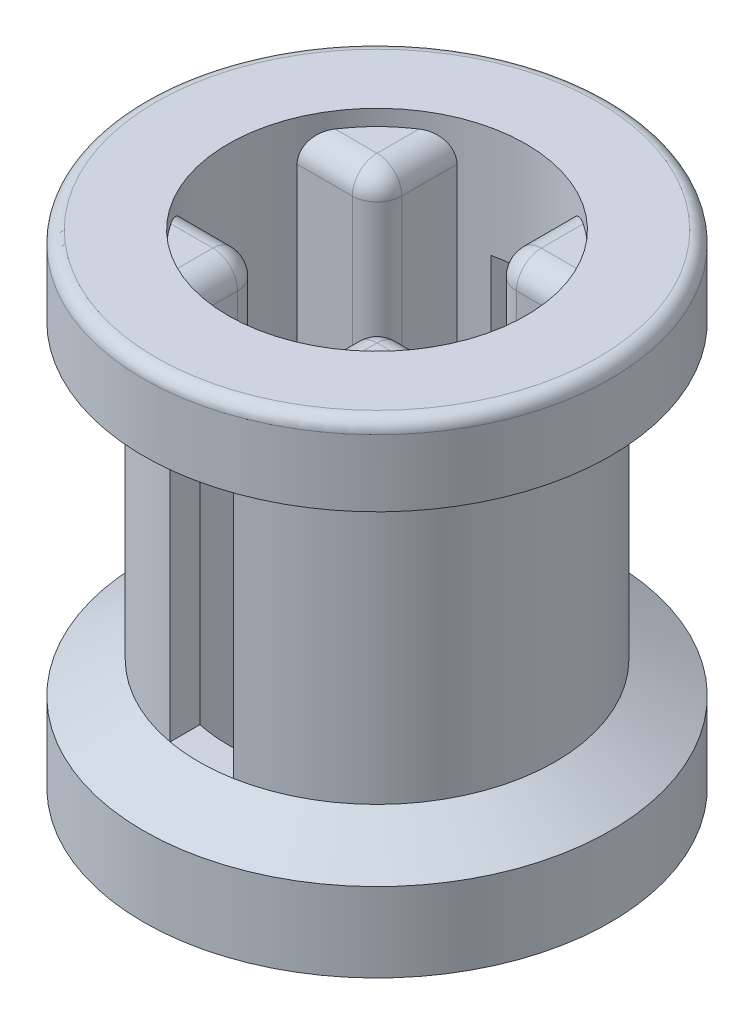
ISO-10303-21;
HEADER;
FILE_DESCRIPTION(('STEP AP214'),'2;1');
FILE_NAME('part.step','',(''),(''),'','','');
FILE_SCHEMA(('AUTOMOTIVE_DESIGN { 1 0 10303 214 1 1 1 1 }'));
ENDSEC;
DATA;
#1=APPLICATION_CONTEXT('core data for automotive mechanical design processes');
#2=APPLICATION_PROTOCOL_DEFINITION('international standard','automotive_design',2000,#1);
#3=PRODUCT_CONTEXT('',#1,'mechanical');
#4=PRODUCT('Part','Part','',(#3));
#5=PRODUCT_RELATED_PRODUCT_CATEGORY('part','',(#4));
#6=PRODUCT_DEFINITION_FORMATION('','',#4);
#7=PRODUCT_DEFINITION_CONTEXT('part definition',#1,'design');
#8=PRODUCT_DEFINITION('design','',#6,#7);
#9=PRODUCT_DEFINITION_SHAPE('','',#8);
#10=(LENGTH_UNIT() NAMED_UNIT(*) SI_UNIT(.MILLI.,.METRE.));
#11=(NAMED_UNIT(*) PLANE_ANGLE_UNIT() SI_UNIT($,.RADIAN.));
#12=(NAMED_UNIT(*) SI_UNIT($,.STERADIAN.) SOLID_ANGLE_UNIT());
#13=UNCERTAINTY_MEASURE_WITH_UNIT(LENGTH_MEASURE(1.E-05),#10,'distance_accuracy_value','');
#14=(GEOMETRIC_REPRESENTATION_CONTEXT(3) GLOBAL_UNCERTAINTY_ASSIGNED_CONTEXT((#13)) GLOBAL_UNIT_ASSIGNED_CONTEXT((#10,
#11,#12)) REPRESENTATION_CONTEXT('',''));
#15=CARTESIAN_POINT('',(0.,0.,0.));
#16=DIRECTION('',(0.,0.,1.));
#17=DIRECTION('',(1.,0.,0.));
#18=AXIS2_PLACEMENT_3D('',#15,#16,#17);
#19=CARTESIAN_POINT('',(-0.920750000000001,0.,-0.92075));
#20=DIRECTION('',(1.,0.,0.));
#21=DIRECTION('',(0.,0.,-1.));
#22=AXIS2_PLACEMENT_3D('',#19,#20,#21);
#23=PLANE('',#22);
#24=DIRECTION('',(0.,1.,0.));
#25=VECTOR('',#24,1.);
#26=CARTESIAN_POINT('',(-0.920750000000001,0.,-2.20291924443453));
#27=LINE('',#26,#25);
#28=CARTESIAN_POINT('',(-0.920750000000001,0.650875,-2.20291924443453));
#29=VERTEX_POINT('',#28);
#30=CARTESIAN_POINT('',(-0.920750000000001,7.096125,-2.20291924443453));
#31=VERTEX_POINT('',#30);
#32=EDGE_CURVE('E629',#29,#31,#27,.T.);
#33=ORIENTED_EDGE('',*,*,#32,.T.);
#34=DIRECTION('',(0.,0.,1.));
#35=VECTOR('',#34,1.);
#36=CARTESIAN_POINT('',(-0.920750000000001,7.096125,-0.92075));
#37=LINE('',#36,#35);
#38=CARTESIAN_POINT('',(-0.920750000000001,7.096125,-1.317625));
#39=VERTEX_POINT('',#38);
#40=EDGE_CURVE('E428',#31,#39,#37,.T.);
#41=ORIENTED_EDGE('',*,*,#40,.T.);
#42=DIRECTION('',(0.,1.,0.));
#43=VECTOR('',#42,1.);
#44=CARTESIAN_POINT('',(-0.920750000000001,0.,-1.317625));
#45=LINE('',#44,#43);
#46=CARTESIAN_POINT('',(-0.920750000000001,0.650875,-1.317625));
#47=VERTEX_POINT('',#46);
#48=EDGE_CURVE('E323',#39,#47,#45,.F.);
#49=ORIENTED_EDGE('',*,*,#48,.T.);
#50=DIRECTION('',(0.,0.,-1.));
#51=VECTOR('',#50,1.);
#52=CARTESIAN_POINT('',(-0.920750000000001,0.650875,-0.92075));
#53=LINE('',#52,#51);
#54=EDGE_CURVE('E61',#47,#29,#53,.T.);
#55=ORIENTED_EDGE('',*,*,#54,.T.);
#56=EDGE_LOOP('',(#33,#41,#49,#55));
#57=FACE_BOUND('',#56,.T.);
#58=ADVANCED_FACE('F34',(#57),#23,.T.);
#59=CARTESIAN_POINT('',(-2.20291924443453,0.,-0.92075));
#60=DIRECTION('',(0.,0.,1.));
#61=DIRECTION('',(1.,0.,0.));
#62=AXIS2_PLACEMENT_3D('',#59,#60,#61);
#63=PLANE('',#62);
#64=DIRECTION('',(0.,1.,0.));
#65=VECTOR('',#64,1.);
#66=CARTESIAN_POINT('',(-1.317625,0.,-0.92075));
#67=LINE('',#66,#65);
#68=CARTESIAN_POINT('',(-1.317625,0.650875,-0.92075));
#69=VERTEX_POINT('',#68);
#70=CARTESIAN_POINT('',(-1.317625,7.096125,-0.92075));
#71=VERTEX_POINT('',#70);
#72=EDGE_CURVE('E320',#69,#71,#67,.T.);
#73=ORIENTED_EDGE('',*,*,#72,.T.);
#74=DIRECTION('',(-1.,0.,0.));
#75=VECTOR('',#74,1.);
#76=CARTESIAN_POINT('',(-2.20291924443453,7.096125,-0.92075));
#77=LINE('',#76,#75);
#78=CARTESIAN_POINT('',(-2.20291924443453,7.096125,-0.92075));
#79=VERTEX_POINT('',#78);
#80=EDGE_CURVE('E375',#71,#79,#77,.T.);
#81=ORIENTED_EDGE('',*,*,#80,.T.);
#82=DIRECTION('',(0.,1.,0.));
#83=VECTOR('',#82,1.);
#84=CARTESIAN_POINT('',(-2.20291924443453,0.,-0.92075));
#85=LINE('',#84,#83);
#86=CARTESIAN_POINT('',(-2.20291924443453,0.650875,-0.92075));
#87=VERTEX_POINT('',#86);
#88=EDGE_CURVE('E625',#87,#79,#85,.T.);
#89=ORIENTED_EDGE('',*,*,#88,.F.);
#90=DIRECTION('',(1.,0.,0.));
#91=VECTOR('',#90,1.);
#92=CARTESIAN_POINT('',(-2.20291924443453,0.650875,-0.92075));
#93=LINE('',#92,#91);
#94=EDGE_CURVE('E372',#87,#69,#93,.T.);
#95=ORIENTED_EDGE('',*,*,#94,.T.);
#96=EDGE_LOOP('',(#73,#81,#89,#95));
#97=FACE_BOUND('',#96,.T.);
#98=ADVANCED_FACE('F515',(#97),#63,.T.);
#99=CARTESIAN_POINT('',(-1.317625,0.,-1.317625));
#100=DIRECTION('',(0.,1.,0.));
#101=DIRECTION('',(0.,0.,1.));
#102=AXIS2_PLACEMENT_3D('',#99,#100,#101);
#103=CYLINDRICAL_SURFACE('',#102,0.396875);
#104=ORIENTED_EDGE('',*,*,#48,.F.);
#105=CARTESIAN_POINT('',(-1.317625,7.096125,-1.317625));
#106=DIRECTION('',(0.,1.,0.));
#107=DIRECTION('',(0.,0.,1.));
#108=AXIS2_PLACEMENT_3D('',#105,#106,#107);
#109=CIRCLE('',#108,0.396875);
#110=EDGE_CURVE('E417',#39,#71,#109,.F.);
#111=ORIENTED_EDGE('',*,*,#110,.T.);
#112=ORIENTED_EDGE('',*,*,#72,.F.);
#113=CARTESIAN_POINT('',(-1.317625,0.650875,-1.317625));
#114=DIRECTION('',(0.,1.,0.));
#115=DIRECTION('',(0.,0.,1.));
#116=AXIS2_PLACEMENT_3D('',#113,#114,#115);
#117=CIRCLE('',#116,0.396875);
#118=EDGE_CURVE('E415',#69,#47,#117,.T.);
#119=ORIENTED_EDGE('',*,*,#118,.T.);
#120=EDGE_LOOP('',(#104,#111,#112,#119));
#121=FACE_BOUND('',#120,.T.);
#122=ADVANCED_FACE('F520',(#121),#103,.T.);
#123=CARTESIAN_POINT('',(0.920750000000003,0.,-0.920749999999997));
#124=DIRECTION('',(0.,0.,1.));
#125=DIRECTION('',(1.,0.,0.));
#126=AXIS2_PLACEMENT_3D('',#123,#124,#125);
#127=PLANE('',#126);
#128=DIRECTION('',(0.,1.,0.));
#129=VECTOR('',#128,1.);
#130=CARTESIAN_POINT('',(2.20291924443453,0.,-0.920749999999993));
#131=LINE('',#130,#129);
#132=CARTESIAN_POINT('',(2.20291924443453,0.650875,-0.920749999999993));
#133=VERTEX_POINT('',#132);
#134=CARTESIAN_POINT('',(2.20291924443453,7.096125,-0.920749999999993));
#135=VERTEX_POINT('',#134);
#136=EDGE_CURVE('E1099',#133,#135,#131,.T.);
#137=ORIENTED_EDGE('',*,*,#136,.T.);
#138=DIRECTION('',(-1.,0.,0.));
#139=VECTOR('',#138,1.);
#140=CARTESIAN_POINT('',(0.920750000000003,7.096125,-0.920749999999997));
#141=LINE('',#140,#139);
#142=CARTESIAN_POINT('',(1.317625,7.096125,-0.920749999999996));
#143=VERTEX_POINT('',#142);
#144=EDGE_CURVE('E365',#135,#143,#141,.T.);
#145=ORIENTED_EDGE('',*,*,#144,.T.);
#146=DIRECTION('',(0.,1.,0.));
#147=VECTOR('',#146,1.);
#148=CARTESIAN_POINT('',(1.317625,0.,-0.920749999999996));
#149=LINE('',#148,#147);
#150=CARTESIAN_POINT('',(1.317625,0.650875,-0.920749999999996));
#151=VERTEX_POINT('',#150);
#152=EDGE_CURVE('E328',#143,#151,#149,.F.);
#153=ORIENTED_EDGE('',*,*,#152,.T.);
#154=DIRECTION('',(1.,0.,0.));
#155=VECTOR('',#154,1.);
#156=CARTESIAN_POINT('',(0.920750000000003,0.650875,-0.920749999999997));
#157=LINE('',#156,#155);
#158=EDGE_CURVE('E362',#151,#133,#157,.T.);
#159=ORIENTED_EDGE('',*,*,#158,.T.);
#160=EDGE_LOOP('',(#137,#145,#153,#159));
#161=FACE_BOUND('',#160,.T.);
#162=ADVANCED_FACE('F1148',(#161),#127,.T.);
#163=CARTESIAN_POINT('',(0.920750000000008,0.,-2.20291924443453));
#164=DIRECTION('',(-1.,0.,0.));
#165=DIRECTION('',(0.,0.,1.));
#166=AXIS2_PLACEMENT_3D('',#163,#164,#165);
#167=PLANE('',#166);
#168=DIRECTION('',(0.,1.,0.));
#169=VECTOR('',#168,1.);
#170=CARTESIAN_POINT('',(0.920750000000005,0.,-1.317625));
#171=LINE('',#170,#169);
#172=CARTESIAN_POINT('',(0.920750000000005,0.650875,-1.317625));
#173=VERTEX_POINT('',#172);
#174=CARTESIAN_POINT('',(0.920750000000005,7.096125,-1.317625));
#175=VERTEX_POINT('',#174);
#176=EDGE_CURVE('E325',#173,#175,#171,.T.);
#177=ORIENTED_EDGE('',*,*,#176,.T.);
#178=DIRECTION('',(0.,0.,-1.));
#179=VECTOR('',#178,1.);
#180=CARTESIAN_POINT('',(0.920750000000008,7.096125,-2.20291924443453));
#181=LINE('',#180,#179);
#182=CARTESIAN_POINT('',(0.920750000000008,7.096125,-2.20291924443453));
#183=VERTEX_POINT('',#182);
#184=EDGE_CURVE('E425',#175,#183,#181,.T.);
#185=ORIENTED_EDGE('',*,*,#184,.T.);
#186=DIRECTION('',(0.,1.,0.));
#187=VECTOR('',#186,1.);
#188=CARTESIAN_POINT('',(0.920750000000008,0.,-2.20291924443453));
#189=LINE('',#188,#187);
#190=CARTESIAN_POINT('',(0.920750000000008,0.650875,-2.20291924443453));
#191=VERTEX_POINT('',#190);
#192=EDGE_CURVE('E1096',#191,#183,#189,.T.);
#193=ORIENTED_EDGE('',*,*,#192,.F.);
#194=DIRECTION('',(0.,0.,1.));
#195=VECTOR('',#194,1.);
#196=CARTESIAN_POINT('',(0.920750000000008,0.650875,-2.20291924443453));
#197=LINE('',#196,#195);
#198=EDGE_CURVE('E423',#191,#173,#197,.T.);
#199=ORIENTED_EDGE('',*,*,#198,.T.);
#200=EDGE_LOOP('',(#177,#185,#193,#199));
#201=FACE_BOUND('',#200,.T.);
#202=ADVANCED_FACE('F1209',(#201),#167,.T.);
#203=CARTESIAN_POINT('',(0.920749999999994,0.,0.920750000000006));
#204=DIRECTION('',(-1.,0.,0.));
#205=DIRECTION('',(0.,0.,1.));
#206=AXIS2_PLACEMENT_3D('',#203,#204,#205);
#207=PLANE('',#206);
#208=DIRECTION('',(0.,1.,0.));
#209=VECTOR('',#208,1.);
#210=CARTESIAN_POINT('',(0.920749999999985,0.,2.20291924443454));
#211=LINE('',#210,#209);
#212=CARTESIAN_POINT('',(0.920749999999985,0.650875,2.20291924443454));
#213=VERTEX_POINT('',#212);
#214=CARTESIAN_POINT('',(0.920749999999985,7.096125,2.20291924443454));
#215=VERTEX_POINT('',#214);
#216=EDGE_CURVE('E1093',#213,#215,#211,.T.);
#217=ORIENTED_EDGE('',*,*,#216,.T.);
#218=DIRECTION('',(0.,0.,-1.));
#219=VECTOR('',#218,1.);
#220=CARTESIAN_POINT('',(0.920749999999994,7.096125,0.920750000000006));
#221=LINE('',#220,#219);
#222=CARTESIAN_POINT('',(0.920749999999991,7.096125,1.31762500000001));
#223=VERTEX_POINT('',#222);
#224=EDGE_CURVE('E421',#215,#223,#221,.T.);
#225=ORIENTED_EDGE('',*,*,#224,.T.);
#226=DIRECTION('',(0.,1.,0.));
#227=VECTOR('',#226,1.);
#228=CARTESIAN_POINT('',(0.920749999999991,0.,1.31762500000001));
#229=LINE('',#228,#227);
#230=CARTESIAN_POINT('',(0.920749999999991,0.650875,1.31762500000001));
#231=VERTEX_POINT('',#230);
#232=EDGE_CURVE('E334',#223,#231,#229,.F.);
#233=ORIENTED_EDGE('',*,*,#232,.T.);
#234=DIRECTION('',(0.,0.,1.));
#235=VECTOR('',#234,1.);
#236=CARTESIAN_POINT('',(0.920749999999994,0.650875,0.920750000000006));
#237=LINE('',#236,#235);
#238=EDGE_CURVE('E419',#231,#213,#237,.T.);
#239=ORIENTED_EDGE('',*,*,#238,.T.);
#240=EDGE_LOOP('',(#217,#225,#233,#239));
#241=FACE_BOUND('',#240,.T.);
#242=ADVANCED_FACE('F1181',(#241),#207,.T.);
#243=CARTESIAN_POINT('',(2.20291924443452,0.,0.920750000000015));
#244=DIRECTION('',(0.,0.,-1.));
#245=DIRECTION('',(-1.,0.,0.));
#246=AXIS2_PLACEMENT_3D('',#243,#244,#245);
#247=PLANE('',#246);
#248=DIRECTION('',(0.,1.,0.));
#249=VECTOR('',#248,1.);
#250=CARTESIAN_POINT('',(1.31762499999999,0.,0.920750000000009));
#251=LINE('',#250,#249);
#252=CARTESIAN_POINT('',(1.31762499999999,0.650875,0.920750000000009));
#253=VERTEX_POINT('',#252);
#254=CARTESIAN_POINT('',(1.31762499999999,7.096125,0.920750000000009));
#255=VERTEX_POINT('',#254);
#256=EDGE_CURVE('E331',#253,#255,#251,.T.);
#257=ORIENTED_EDGE('',*,*,#256,.T.);
#258=DIRECTION('',(1.,0.,0.));
#259=VECTOR('',#258,1.);
#260=CARTESIAN_POINT('',(2.20291924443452,7.096125,0.920750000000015));
#261=LINE('',#260,#259);
#262=CARTESIAN_POINT('',(2.20291924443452,7.096125,0.920750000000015));
#263=VERTEX_POINT('',#262);
#264=EDGE_CURVE('E355',#255,#263,#261,.T.);
#265=ORIENTED_EDGE('',*,*,#264,.T.);
#266=DIRECTION('',(0.,1.,0.));
#267=VECTOR('',#266,1.);
#268=CARTESIAN_POINT('',(2.20291924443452,0.,0.920750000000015));
#269=LINE('',#268,#267);
#270=CARTESIAN_POINT('',(2.20291924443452,0.650875,0.920750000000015));
#271=VERTEX_POINT('',#270);
#272=EDGE_CURVE('E1088',#271,#263,#269,.T.);
#273=ORIENTED_EDGE('',*,*,#272,.F.);
#274=DIRECTION('',(-1.,0.,0.));
#275=VECTOR('',#274,1.);
#276=CARTESIAN_POINT('',(2.20291924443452,0.650875,0.920750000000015));
#277=LINE('',#276,#275);
#278=EDGE_CURVE('E352',#271,#253,#277,.T.);
#279=ORIENTED_EDGE('',*,*,#278,.T.);
#280=EDGE_LOOP('',(#257,#265,#273,#279));
#281=FACE_BOUND('',#280,.T.);
#282=ADVANCED_FACE('F1171',(#281),#247,.T.);
#283=CARTESIAN_POINT('',(-0.92075000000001,0.,0.920749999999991));
#284=DIRECTION('',(0.,0.,-1.));
#285=DIRECTION('',(-1.,0.,0.));
#286=AXIS2_PLACEMENT_3D('',#283,#284,#285);
#287=PLANE('',#286);
#288=DIRECTION('',(0.,1.,0.));
#289=VECTOR('',#288,1.);
#290=CARTESIAN_POINT('',(-2.20291924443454,0.,0.920749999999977));
#291=LINE('',#290,#289);
#292=CARTESIAN_POINT('',(-2.20291924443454,0.650875,0.920749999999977));
#293=VERTEX_POINT('',#292);
#294=CARTESIAN_POINT('',(-2.20291924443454,7.096125,0.920749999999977));
#295=VERTEX_POINT('',#294);
#296=EDGE_CURVE('E1025',#293,#295,#291,.T.);
#297=ORIENTED_EDGE('',*,*,#296,.T.);
#298=DIRECTION('',(1.,0.,0.));
#299=VECTOR('',#298,1.);
#300=CARTESIAN_POINT('',(-0.92075000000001,7.096125,0.920749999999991));
#301=LINE('',#300,#299);
#302=CARTESIAN_POINT('',(-1.31762500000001,7.096125,0.920749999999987));
#303=VERTEX_POINT('',#302);
#304=EDGE_CURVE('E345',#295,#303,#301,.T.);
#305=ORIENTED_EDGE('',*,*,#304,.T.);
#306=DIRECTION('',(0.,1.,0.));
#307=VECTOR('',#306,1.);
#308=CARTESIAN_POINT('',(-1.31762500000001,0.,0.920749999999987));
#309=LINE('',#308,#307);
#310=CARTESIAN_POINT('',(-1.31762500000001,0.650875,0.920749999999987));
#311=VERTEX_POINT('',#310);
#312=EDGE_CURVE('E340',#303,#311,#309,.F.);
#313=ORIENTED_EDGE('',*,*,#312,.T.);
#314=DIRECTION('',(-1.,0.,0.));
#315=VECTOR('',#314,1.);
#316=CARTESIAN_POINT('',(-0.92075000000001,0.650875,0.920749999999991));
#317=LINE('',#316,#315);
#318=EDGE_CURVE('E343',#311,#293,#317,.T.);
#319=ORIENTED_EDGE('',*,*,#318,.T.);
#320=EDGE_LOOP('',(#297,#305,#313,#319));
#321=FACE_BOUND('',#320,.T.);
#322=ADVANCED_FACE('F1200',(#321),#287,.T.);
#323=CARTESIAN_POINT('',(-0.920750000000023,0.,2.20291924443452));
#324=DIRECTION('',(1.,0.,0.));
#325=DIRECTION('',(0.,0.,-1.));
#326=AXIS2_PLACEMENT_3D('',#323,#324,#325);
#327=PLANE('',#326);
#328=DIRECTION('',(0.,1.,0.));
#329=VECTOR('',#328,1.);
#330=CARTESIAN_POINT('',(-0.920750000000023,0.,2.20291924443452));
#331=LINE('',#330,#329);
#332=CARTESIAN_POINT('',(-0.920750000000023,0.650875,2.20291924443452));
#333=VERTEX_POINT('',#332);
#334=CARTESIAN_POINT('',(-0.920750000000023,7.096125,2.20291924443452));
#335=VERTEX_POINT('',#334);
#336=EDGE_CURVE('E1089',#333,#335,#331,.T.);
#337=ORIENTED_EDGE('',*,*,#336,.F.);
#338=DIRECTION('',(0.,0.,-1.));
#339=VECTOR('',#338,1.);
#340=CARTESIAN_POINT('',(-0.920750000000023,0.650875,2.20291924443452));
#341=LINE('',#340,#339);
#342=CARTESIAN_POINT('',(-0.920750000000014,0.650875,1.31762499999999));
#343=VERTEX_POINT('',#342);
#344=EDGE_CURVE('E392',#333,#343,#341,.T.);
#345=ORIENTED_EDGE('',*,*,#344,.T.);
#346=DIRECTION('',(0.,1.,0.));
#347=VECTOR('',#346,1.);
#348=CARTESIAN_POINT('',(-0.920750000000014,0.,1.31762499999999));
#349=LINE('',#348,#347);
#350=CARTESIAN_POINT('',(-0.920750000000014,7.096125,1.31762499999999));
#351=VERTEX_POINT('',#350);
#352=EDGE_CURVE('E337',#343,#351,#349,.T.);
#353=ORIENTED_EDGE('',*,*,#352,.T.);
#354=DIRECTION('',(0.,0.,1.));
#355=VECTOR('',#354,1.);
#356=CARTESIAN_POINT('',(-0.920750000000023,7.096125,2.20291924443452));
#357=LINE('',#356,#355);
#358=EDGE_CURVE('E390',#351,#335,#357,.T.);
#359=ORIENTED_EDGE('',*,*,#358,.T.);
#360=EDGE_LOOP('',(#337,#345,#353,#359));
#361=FACE_BOUND('',#360,.T.);
#362=ADVANCED_FACE('F1197',(#361),#327,.T.);
#363=CARTESIAN_POINT('',(1.317625,0.,-1.317625));
#364=DIRECTION('',(0.,1.,0.));
#365=DIRECTION('',(0.,0.,1.));
#366=AXIS2_PLACEMENT_3D('',#363,#364,#365);
#367=CYLINDRICAL_SURFACE('',#366,0.396875);
#368=ORIENTED_EDGE('',*,*,#152,.F.);
#369=CARTESIAN_POINT('',(1.317625,7.096125,-1.317625));
#370=DIRECTION('',(0.,1.,0.));
#371=DIRECTION('',(0.,0.,1.));
#372=AXIS2_PLACEMENT_3D('',#369,#370,#371);
#373=CIRCLE('',#372,0.396875);
#374=EDGE_CURVE('E413',#143,#175,#373,.F.);
#375=ORIENTED_EDGE('',*,*,#374,.T.);
#376=ORIENTED_EDGE('',*,*,#176,.F.);
#377=CARTESIAN_POINT('',(1.317625,0.650875,-1.317625));
#378=DIRECTION('',(0.,1.,0.));
#379=DIRECTION('',(0.,0.,1.));
#380=AXIS2_PLACEMENT_3D('',#377,#378,#379);
#381=CIRCLE('',#380,0.396875);
#382=EDGE_CURVE('E411',#173,#151,#381,.T.);
#383=ORIENTED_EDGE('',*,*,#382,.T.);
#384=EDGE_LOOP('',(#368,#375,#376,#383));
#385=FACE_BOUND('',#384,.T.);
#386=ADVANCED_FACE('F1151',(#385),#367,.T.);
#387=CARTESIAN_POINT('',(1.31762499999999,0.,1.31762500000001));
#388=DIRECTION('',(0.,1.,0.));
#389=DIRECTION('',(0.,0.,1.));
#390=AXIS2_PLACEMENT_3D('',#387,#388,#389);
#391=CYLINDRICAL_SURFACE('',#390,0.396875);
#392=ORIENTED_EDGE('',*,*,#232,.F.);
#393=CARTESIAN_POINT('',(1.31762499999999,7.096125,1.31762500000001));
#394=DIRECTION('',(0.,1.,0.));
#395=DIRECTION('',(0.,0.,1.));
#396=AXIS2_PLACEMENT_3D('',#393,#394,#395);
#397=CIRCLE('',#396,0.396875);
#398=EDGE_CURVE('E409',#223,#255,#397,.F.);
#399=ORIENTED_EDGE('',*,*,#398,.T.);
#400=ORIENTED_EDGE('',*,*,#256,.F.);
#401=CARTESIAN_POINT('',(1.31762499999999,0.650875,1.31762500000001));
#402=DIRECTION('',(0.,1.,0.));
#403=DIRECTION('',(0.,0.,1.));
#404=AXIS2_PLACEMENT_3D('',#401,#402,#403);
#405=CIRCLE('',#404,0.396875);
#406=EDGE_CURVE('E407',#253,#231,#405,.T.);
#407=ORIENTED_EDGE('',*,*,#406,.T.);
#408=EDGE_LOOP('',(#392,#399,#400,#407));
#409=FACE_BOUND('',#408,.T.);
#410=ADVANCED_FACE('F1190',(#409),#391,.T.);
#411=CARTESIAN_POINT('',(-1.31762500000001,0.,1.31762499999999));
#412=DIRECTION('',(0.,1.,0.));
#413=DIRECTION('',(0.,0.,1.));
#414=AXIS2_PLACEMENT_3D('',#411,#412,#413);
#415=CYLINDRICAL_SURFACE('',#414,0.396875);
#416=ORIENTED_EDGE('',*,*,#312,.F.);
#417=CARTESIAN_POINT('',(-1.31762500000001,7.096125,1.31762499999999));
#418=DIRECTION('',(0.,1.,0.));
#419=DIRECTION('',(0.,0.,1.));
#420=AXIS2_PLACEMENT_3D('',#417,#418,#419);
#421=CIRCLE('',#420,0.396875);
#422=EDGE_CURVE('E405',#303,#351,#421,.F.);
#423=ORIENTED_EDGE('',*,*,#422,.T.);
#424=ORIENTED_EDGE('',*,*,#352,.F.);
#425=CARTESIAN_POINT('',(-1.31762500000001,0.650875,1.31762499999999));
#426=DIRECTION('',(0.,1.,0.));
#427=DIRECTION('',(0.,0.,1.));
#428=AXIS2_PLACEMENT_3D('',#425,#426,#427);
#429=CIRCLE('',#428,0.396875);
#430=EDGE_CURVE('E403',#343,#311,#429,.T.);
#431=ORIENTED_EDGE('',*,*,#430,.T.);
#432=EDGE_LOOP('',(#416,#423,#424,#431));
#433=FACE_BOUND('',#432,.T.);
#434=ADVANCED_FACE('F704',(#433),#415,.T.);
#435=CARTESIAN_POINT('',(0.,0.,0.));
#436=DIRECTION('',(0.,-1.,0.));
#437=DIRECTION('',(0.,0.,-1.));
#438=AXIS2_PLACEMENT_3D('',#435,#436,#437);
#439=CYLINDRICAL_SURFACE('',#438,2.8575);
#440=CARTESIAN_POINT('',(0.,5.96373561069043,0.));
#441=DIRECTION('',(0.,-1.,0.));
#442=DIRECTION('',(0.,0.,-1.));
#443=AXIS2_PLACEMENT_3D('',#440,#441,#442);
#444=CIRCLE('',#443,2.8575);
#445=CARTESIAN_POINT('',(-0.508,5.96373561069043,2.81198190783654));
#446=VERTEX_POINT('',#445);
#447=CARTESIAN_POINT('',(-0.508,5.96373561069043,-2.81198190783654));
#448=VERTEX_POINT('',#447);
#449=EDGE_CURVE('E643',#446,#448,#444,.T.);
#450=ORIENTED_EDGE('',*,*,#449,.T.);
#451=DIRECTION('',(0.,-1.,0.));
#452=VECTOR('',#451,1.);
#453=CARTESIAN_POINT('',(-0.508,0.,-2.81198190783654));
#454=LINE('',#453,#452);
#455=CARTESIAN_POINT('',(-0.508,1.78326438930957,-2.81198190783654));
#456=VERTEX_POINT('',#455);
#457=EDGE_CURVE('E569',#448,#456,#454,.T.);
#458=ORIENTED_EDGE('',*,*,#457,.T.);
#459=CARTESIAN_POINT('',(0.,1.78326438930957,0.));
#460=DIRECTION('',(0.,-1.,0.));
#461=DIRECTION('',(0.,0.,-1.));
#462=AXIS2_PLACEMENT_3D('',#459,#460,#461);
#463=CIRCLE('',#462,2.8575);
#464=CARTESIAN_POINT('',(-0.508,1.78326438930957,2.81198190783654));
#465=VERTEX_POINT('',#464);
#466=EDGE_CURVE('E647',#465,#456,#463,.T.);
#467=ORIENTED_EDGE('',*,*,#466,.F.);
#468=DIRECTION('',(0.,-1.,0.));
#469=VECTOR('',#468,1.);
#470=CARTESIAN_POINT('',(-0.508,0.,2.81198190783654));
#471=LINE('',#470,#469);
#472=EDGE_CURVE('E570',#465,#446,#471,.F.);
#473=ORIENTED_EDGE('',*,*,#472,.T.);
#474=EDGE_LOOP('',(#450,#458,#467,#473));
#475=FACE_BOUND('',#474,.T.);
#476=ADVANCED_FACE('F665',(#475),#439,.T.);
#477=CARTESIAN_POINT('',(0.,7.747,0.));
#478=DIRECTION('',(0.,-1.,0.));
#479=DIRECTION('',(0.,0.,-1.));
#480=AXIS2_PLACEMENT_3D('',#477,#478,#479);
#481=PLANE('',#480);
#482=CARTESIAN_POINT('',(0.,7.747,0.));
#483=DIRECTION('',(0.,-1.,0.));
#484=DIRECTION('',(0.,0.,-1.));
#485=AXIS2_PLACEMENT_3D('',#482,#483,#484);
#486=CIRCLE('',#485,3.5480625);
#487=CARTESIAN_POINT('',(0.,7.747,-3.5480625));
#488=VERTEX_POINT('',#487);
#489=EDGE_CURVE('E589',#488,#488,#486,.F.);
#490=ORIENTED_EDGE('',*,*,#489,.T.);
#491=EDGE_LOOP('',(#490));
#492=FACE_BOUND('',#491,.T.);
#493=CARTESIAN_POINT('',(0.,7.747,0.));
#494=DIRECTION('',(0.,1.,0.));
#495=DIRECTION('',(0.,0.,1.));
#496=AXIS2_PLACEMENT_3D('',#493,#494,#495);
#497=CIRCLE('',#496,2.3876);
#498=CARTESIAN_POINT('',(0.,7.747,2.3876));
#499=VERTEX_POINT('',#498);
#500=EDGE_CURVE('E656',#499,#499,#497,.T.);
#501=ORIENTED_EDGE('',*,*,#500,.F.);
#502=EDGE_LOOP('',(#501));
#503=FACE_BOUND('',#502,.T.);
#504=ADVANCED_FACE('F36',(#492,#503),#481,.F.);
#505=CARTESIAN_POINT('',(0.,0.,0.));
#506=DIRECTION('',(0.,-1.,0.));
#507=DIRECTION('',(0.,0.,-1.));
#508=AXIS2_PLACEMENT_3D('',#505,#506,#507);
#509=CYLINDRICAL_SURFACE('',#508,3.7465);
#510=CARTESIAN_POINT('',(0.,7.5485625,0.));
#511=DIRECTION('',(0.,-1.,0.));
#512=DIRECTION('',(0.,0.,-1.));
#513=AXIS2_PLACEMENT_3D('',#510,#511,#512);
#514=CIRCLE('',#513,3.7465);
#515=CARTESIAN_POINT('',(0.,7.5485625,-3.7465));
#516=VERTEX_POINT('',#515);
#517=EDGE_CURVE('E592',#516,#516,#514,.T.);
#518=ORIENTED_EDGE('',*,*,#517,.T.);
#519=EDGE_LOOP('',(#518));
#520=FACE_BOUND('',#519,.T.);
#521=CARTESIAN_POINT('',(0.,6.477,0.));
#522=DIRECTION('',(0.,-1.,0.));
#523=DIRECTION('',(0.,0.,-1.));
#524=AXIS2_PLACEMENT_3D('',#521,#522,#523);
#525=CIRCLE('',#524,3.7465);
#526=CARTESIAN_POINT('',(0.,6.477,-3.7465));
#527=VERTEX_POINT('',#526);
#528=EDGE_CURVE('E594',#527,#527,#525,.T.);
#529=ORIENTED_EDGE('',*,*,#528,.F.);
#530=EDGE_LOOP('',(#529));
#531=FACE_BOUND('',#530,.T.);
#532=ADVANCED_FACE('F557',(#520,#531),#509,.T.);
#533=CARTESIAN_POINT('',(0.,6.477,0.));
#534=DIRECTION('',(0.,1.,0.));
#535=DIRECTION('',(0.,0.,1.));
#536=AXIS2_PLACEMENT_3D('',#533,#534,#535);
#537=CONICAL_SURFACE('',#536,3.7465,1.0471975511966);
#538=ORIENTED_EDGE('',*,*,#449,.F.);
#539=CARTESIAN_POINT('',(-0.507999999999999,9.0817982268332,-8.24250324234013));
#540=CARTESIAN_POINT('',(-0.507999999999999,8.88113616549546,-7.89427498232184));
#541=CARTESIAN_POINT('',(-0.507999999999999,8.68050072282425,-7.54603135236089));
#542=CARTESIAN_POINT('',(-0.507999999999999,8.27933981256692,-6.84947911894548));
#543=CARTESIAN_POINT('',(-0.508,8.07881434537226,-6.50117051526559));
#544=CARTESIAN_POINT('',(-0.508,7.67807908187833,-5.80471297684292));
#545=CARTESIAN_POINT('',(-0.508,7.47786916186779,-5.4565641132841));
#546=CARTESIAN_POINT('',(-0.508,7.07773578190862,-4.76010307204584));
#547=CARTESIAN_POINT('',(-0.507999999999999,6.87781232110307,-4.41179089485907));
#548=CARTESIAN_POINT('',(-0.508,6.57918953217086,-3.89052855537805));
#549=CARTESIAN_POINT('',(-0.508,6.48027386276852,-3.71770235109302));
#550=CARTESIAN_POINT('',(-0.508,6.28265700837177,-3.37192576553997));
#551=CARTESIAN_POINT('',(-0.508,6.18395582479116,-3.19897538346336));
#552=CARTESIAN_POINT('',(-0.508,5.98684769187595,-2.85279569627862));
#553=CARTESIAN_POINT('',(-0.508,5.88844090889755,-2.67956629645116));
#554=CARTESIAN_POINT('',(-0.508,5.69220674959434,-2.3327829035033));
#555=CARTESIAN_POINT('',(-0.508,5.59437936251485,-2.15922891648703));
#556=CARTESIAN_POINT('',(-0.508,5.44848197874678,-1.89837443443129));
#557=CARTESIAN_POINT('',(-0.508,5.39997934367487,-1.81131609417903));
#558=CARTESIAN_POINT('',(-0.508,5.30341131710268,-1.63695140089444));
#559=CARTESIAN_POINT('',(-0.508,5.25534594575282,-1.54964503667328));
#560=CARTESIAN_POINT('',(-0.508,5.1599555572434,-1.37473551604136));
#561=CARTESIAN_POINT('',(-0.508,5.11262988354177,-1.28713271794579));
#562=CARTESIAN_POINT('',(-0.508,5.01914556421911,-1.11131216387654));
#563=CARTESIAN_POINT('',(-0.508,4.97298679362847,-1.02309447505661));
#564=CARTESIAN_POINT('',(-0.508,4.90554944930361,-0.890119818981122));
#565=CARTESIAN_POINT('',(-0.508,4.8834220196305,-0.845795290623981));
#566=CARTESIAN_POINT('',(-0.508,4.83999629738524,-0.756743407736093));
#567=CARTESIAN_POINT('',(-0.508,4.81869796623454,-0.71201607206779));
#568=CARTESIAN_POINT('',(-0.508,4.77725545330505,-0.621791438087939));
#569=CARTESIAN_POINT('',(-0.508,4.7571164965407,-0.576291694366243));
#570=CARTESIAN_POINT('',(-0.508,4.71883334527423,-0.484479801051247));
#571=CARTESIAN_POINT('',(-0.508,4.70068856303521,-0.438167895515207));
#572=CARTESIAN_POINT('',(-0.508,4.66343351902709,-0.33244395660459));
#573=CARTESIAN_POINT('',(-0.508,4.64523810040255,-0.272679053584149));
#574=CARTESIAN_POINT('',(-0.508,4.62504944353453,-0.181745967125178));
#575=CARTESIAN_POINT('',(-0.508,4.6195148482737,-0.151384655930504));
#576=CARTESIAN_POINT('',(-0.508,4.61135188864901,-0.0902730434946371));
#577=CARTESIAN_POINT('',(-0.508,4.60872207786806,-0.0595229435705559));
#578=CARTESIAN_POINT('',(-0.508,4.6067057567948,0.00242600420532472));
#579=CARTESIAN_POINT('',(-0.508,4.6073551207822,0.0336260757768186));
#580=CARTESIAN_POINT('',(-0.508,4.61188672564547,0.0957892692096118));
#581=CARTESIAN_POINT('',(-0.508,4.61576995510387,0.126752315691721));
#582=CARTESIAN_POINT('',(-0.508,4.62632899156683,0.188544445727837));
#583=CARTESIAN_POINT('',(-0.508,4.63303610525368,0.219367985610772));
#584=CARTESIAN_POINT('',(-0.508,4.64860627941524,0.28045669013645));
#585=CARTESIAN_POINT('',(-0.508,4.65746976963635,0.310721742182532));
#586=CARTESIAN_POINT('',(-0.508,4.68566000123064,0.398428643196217));
#587=CARTESIAN_POINT('',(-0.508,4.70709535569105,0.455181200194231));
#588=CARTESIAN_POINT('',(-0.508,4.75308121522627,0.567425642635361));
#589=CARTESIAN_POINT('',(-0.508,4.77763540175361,0.62291594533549));
#590=CARTESIAN_POINT('',(-0.508,4.82859621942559,0.733202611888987));
#591=CARTESIAN_POINT('',(-0.508,4.85500731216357,0.787996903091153));
#592=CARTESIAN_POINT('',(-0.508,4.90892636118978,0.897044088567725));
#593=CARTESIAN_POINT('',(-0.508,4.93643442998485,0.951296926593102));
#594=CARTESIAN_POINT('',(-0.508,4.99224467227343,1.05960092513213));
#595=CARTESIAN_POINT('',(-0.508,5.02054901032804,1.11365096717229));
#596=CARTESIAN_POINT('',(-0.508,5.07764722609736,1.22149993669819));
#597=CARTESIAN_POINT('',(-0.508,5.1064411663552,1.27529883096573));
#598=CARTESIAN_POINT('',(-0.508,5.19321929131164,1.43621961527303));
#599=CARTESIAN_POINT('',(-0.508,5.25170661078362,1.54306980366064));
#600=CARTESIAN_POINT('',(-0.508,5.36873706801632,1.75515138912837));
#601=CARTESIAN_POINT('',(-0.508,5.42727196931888,1.86038735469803));
#602=CARTESIAN_POINT('',(-0.508,5.54478495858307,2.07061202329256));
#603=CARTESIAN_POINT('',(-0.508,5.60376304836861,2.17560072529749));
#604=CARTESIAN_POINT('',(-0.508,5.78112209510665,2.49033530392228));
#605=CARTESIAN_POINT('',(-0.508,5.89992438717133,2.69984346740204));
#606=CARTESIAN_POINT('',(-0.508,6.13815658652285,3.11870028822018));
#607=CARTESIAN_POINT('',(-0.508,6.25758688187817,3.32804872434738));
#608=CARTESIAN_POINT('',(-0.508,6.49676181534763,3.74656244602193));
#609=CARTESIAN_POINT('',(-0.508,6.61650644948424,3.95572773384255));
#610=CARTESIAN_POINT('',(-0.508,6.85577759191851,4.37322746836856));
#611=CARTESIAN_POINT('',(-0.508,6.97530343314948,4.58156229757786));
#612=CARTESIAN_POINT('',(-0.508,7.21448444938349,4.99815861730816));
#613=CARTESIAN_POINT('',(-0.508,7.33413962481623,5.20642010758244));
#614=CARTESIAN_POINT('',(-0.508,7.69319338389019,5.83105316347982));
#615=CARTESIAN_POINT('',(-0.507999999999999,7.93272364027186,6.24734903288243));
#616=CARTESIAN_POINT('',(-0.507999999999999,8.24804767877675,6.79508880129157));
#617=CARTESIAN_POINT('',(-0.507999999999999,8.32375772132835,6.92658093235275));
#618=CARTESIAN_POINT('',(-0.507999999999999,8.47519700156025,7.18956026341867));
#619=CARTESIAN_POINT('',(-0.507999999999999,8.5509262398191,7.32104746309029));
#620=CARTESIAN_POINT('',(-0.507999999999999,8.70250707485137,7.58420234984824));
#621=CARTESIAN_POINT('',(-0.507999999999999,8.77835869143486,7.71587002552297));
#622=CARTESIAN_POINT('',(-0.507999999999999,8.9300712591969,7.97919385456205));
#623=CARTESIAN_POINT('',(-0.507999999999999,9.00593220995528,8.11085000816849));
#624=CARTESIAN_POINT('',(-0.507999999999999,9.0817982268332,8.24250324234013));
#625=B_SPLINE_CURVE_WITH_KNOTS('',3,(#539,#540,#541,#542,#543,#544,#545,#546,#547,#548,#549,
#550,#551,#552,#553,#554,#555,#556,#557,#558,#559,#560,#561,#562,#563,#564,#565,#566,#567,#568,
#569,#570,#571,#572,#573,#574,#575,#576,#577,#578,#579,#580,#581,#582,#583,#584,#585,#586,#587,
#588,#589,#590,#591,#592,#593,#594,#595,#596,#597,#598,#599,#600,#601,#602,#603,#604,#605,#606,
#607,#608,#609,#610,#611,#612,#613,#614,#615,#616,#617,#618,#619,#620,#621,#622,#623,#624),
.UNSPECIFIED.,.F.,.F.,(4,2,2,2,2,2,2,2,2,2,2,2,2,2,2,2,2,2,2,2,2,2,2,2,2,2,2,2,2,2,2,2,2,2,2,2,
2,2,2,2,2,2,4),(0.,1.20571711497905,2.41143849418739,3.61627238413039,4.821102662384,
5.41849597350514,6.0158932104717,6.61358085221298,7.2112573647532,7.51022983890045,
7.80921602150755,8.10791973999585,8.40659133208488,8.55520732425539,8.70381639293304,
8.85304982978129,9.00223916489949,9.18913124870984,9.2816035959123,9.37402987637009,
9.4674694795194,9.56093765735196,9.65547054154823,9.7500222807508,9.93181165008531,
10.1138176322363,10.2962769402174,10.4787550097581,10.6617891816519,10.8448469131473,
11.2102710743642,11.571529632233,11.932789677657,12.6553310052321,13.3783890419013,
14.1014379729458,14.8219991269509,15.5425626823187,16.9834279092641,17.4386198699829,
17.8938277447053,18.3496880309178,18.8055323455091),.UNSPECIFIED.);
#626=CARTESIAN_POINT('',(-0.508,5.97273465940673,2.82781962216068));
#627=VERTEX_POINT('',#626);
#628=EDGE_CURVE('E562',#446,#627,#625,.T.);
#629=ORIENTED_EDGE('',*,*,#628,.T.);
#630=CARTESIAN_POINT('',(0.,5.97273465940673,0.));
#631=DIRECTION('',(0.,-1.,0.));
#632=DIRECTION('',(0.,0.,-1.));
#633=AXIS2_PLACEMENT_3D('',#630,#631,#632);
#634=CIRCLE('',#633,2.87308680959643);
#635=CARTESIAN_POINT('',(0.508,5.97273465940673,2.82781962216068));
#636=VERTEX_POINT('',#635);
#637=EDGE_CURVE('E617',#636,#627,#634,.T.);
#638=ORIENTED_EDGE('',*,*,#637,.F.);
#639=CARTESIAN_POINT('',(0.507999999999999,9.0817982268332,8.24250324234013));
#640=CARTESIAN_POINT('',(0.507999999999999,8.88113616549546,7.89427498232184));
#641=CARTESIAN_POINT('',(0.507999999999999,8.68050072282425,7.54603135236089));
#642=CARTESIAN_POINT('',(0.507999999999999,8.27933981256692,6.84947911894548));
#643=CARTESIAN_POINT('',(0.508,8.07881434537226,6.50117051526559));
#644=CARTESIAN_POINT('',(0.508,7.67807908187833,5.80471297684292));
#645=CARTESIAN_POINT('',(0.508,7.47786916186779,5.4565641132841));
#646=CARTESIAN_POINT('',(0.508,7.07773578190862,4.76010307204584));
#647=CARTESIAN_POINT('',(0.507999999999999,6.87781232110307,4.41179089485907));
#648=CARTESIAN_POINT('',(0.508,6.57918953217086,3.89052855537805));
#649=CARTESIAN_POINT('',(0.508,6.48027386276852,3.71770235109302));
#650=CARTESIAN_POINT('',(0.508,6.28265700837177,3.37192576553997));
#651=CARTESIAN_POINT('',(0.508,6.18395582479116,3.19897538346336));
#652=CARTESIAN_POINT('',(0.508,5.98684769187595,2.85279569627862));
#653=CARTESIAN_POINT('',(0.508,5.88844090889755,2.67956629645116));
#654=CARTESIAN_POINT('',(0.508,5.69220674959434,2.3327829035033));
#655=CARTESIAN_POINT('',(0.508,5.59437936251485,2.15922891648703));
#656=CARTESIAN_POINT('',(0.508,5.44848197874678,1.89837443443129));
#657=CARTESIAN_POINT('',(0.508,5.39997934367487,1.81131609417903));
#658=CARTESIAN_POINT('',(0.508,5.30341131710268,1.63695140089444));
#659=CARTESIAN_POINT('',(0.508,5.25534594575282,1.54964503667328));
#660=CARTESIAN_POINT('',(0.508,5.1599555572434,1.37473551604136));
#661=CARTESIAN_POINT('',(0.508,5.11262988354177,1.28713271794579));
#662=CARTESIAN_POINT('',(0.508,5.01914556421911,1.11131216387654));
#663=CARTESIAN_POINT('',(0.508,4.97298679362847,1.02309447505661));
#664=CARTESIAN_POINT('',(0.508,4.90554944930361,0.890119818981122));
#665=CARTESIAN_POINT('',(0.508,4.8834220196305,0.845795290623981));
#666=CARTESIAN_POINT('',(0.508,4.83999629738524,0.756743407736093));
#667=CARTESIAN_POINT('',(0.508,4.81869796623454,0.71201607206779));
#668=CARTESIAN_POINT('',(0.508,4.77725545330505,0.621791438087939));
#669=CARTESIAN_POINT('',(0.508,4.7571164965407,0.576291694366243));
#670=CARTESIAN_POINT('',(0.508,4.71883334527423,0.484479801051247));
#671=CARTESIAN_POINT('',(0.508,4.70068856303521,0.438167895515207));
#672=CARTESIAN_POINT('',(0.508,4.66343351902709,0.33244395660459));
#673=CARTESIAN_POINT('',(0.508,4.64523810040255,0.272679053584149));
#674=CARTESIAN_POINT('',(0.508,4.62504944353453,0.181745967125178));
#675=CARTESIAN_POINT('',(0.508,4.6195148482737,0.151384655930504));
#676=CARTESIAN_POINT('',(0.508,4.61135188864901,0.0902730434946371));
#677=CARTESIAN_POINT('',(0.508,4.60872207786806,0.0595229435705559));
#678=CARTESIAN_POINT('',(0.508,4.6067057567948,-0.00242600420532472));
#679=CARTESIAN_POINT('',(0.508,4.6073551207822,-0.0336260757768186));
#680=CARTESIAN_POINT('',(0.508,4.61188672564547,-0.0957892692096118));
#681=CARTESIAN_POINT('',(0.508,4.61576995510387,-0.126752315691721));
#682=CARTESIAN_POINT('',(0.508,4.62632899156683,-0.188544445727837));
#683=CARTESIAN_POINT('',(0.508,4.63303610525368,-0.219367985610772));
#684=CARTESIAN_POINT('',(0.508,4.64860627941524,-0.28045669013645));
#685=CARTESIAN_POINT('',(0.508,4.65746976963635,-0.310721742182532));
#686=CARTESIAN_POINT('',(0.508,4.68566000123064,-0.398428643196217));
#687=CARTESIAN_POINT('',(0.508,4.70709535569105,-0.455181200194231));
#688=CARTESIAN_POINT('',(0.508,4.75308121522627,-0.567425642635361));
#689=CARTESIAN_POINT('',(0.508,4.77763540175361,-0.62291594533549));
#690=CARTESIAN_POINT('',(0.508,4.82859621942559,-0.733202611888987));
#691=CARTESIAN_POINT('',(0.508,4.85500731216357,-0.787996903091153));
#692=CARTESIAN_POINT('',(0.508,4.90892636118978,-0.897044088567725));
#693=CARTESIAN_POINT('',(0.508,4.93643442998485,-0.951296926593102));
#694=CARTESIAN_POINT('',(0.508,4.99224467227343,-1.05960092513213));
#695=CARTESIAN_POINT('',(0.508,5.02054901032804,-1.11365096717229));
#696=CARTESIAN_POINT('',(0.508,5.07764722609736,-1.22149993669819));
#697=CARTESIAN_POINT('',(0.508,5.1064411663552,-1.27529883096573));
#698=CARTESIAN_POINT('',(0.508,5.19321929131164,-1.43621961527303));
#699=CARTESIAN_POINT('',(0.508,5.25170661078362,-1.54306980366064));
#700=CARTESIAN_POINT('',(0.508,5.36873706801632,-1.75515138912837));
#701=CARTESIAN_POINT('',(0.508,5.42727196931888,-1.86038735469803));
#702=CARTESIAN_POINT('',(0.508,5.54478495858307,-2.07061202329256));
#703=CARTESIAN_POINT('',(0.508,5.60376304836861,-2.17560072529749));
#704=CARTESIAN_POINT('',(0.508,5.78112209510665,-2.49033530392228));
#705=CARTESIAN_POINT('',(0.508,5.89992438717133,-2.69984346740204));
#706=CARTESIAN_POINT('',(0.508,6.13815658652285,-3.11870028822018));
#707=CARTESIAN_POINT('',(0.508,6.25758688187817,-3.32804872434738));
#708=CARTESIAN_POINT('',(0.508,6.49676181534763,-3.74656244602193));
#709=CARTESIAN_POINT('',(0.508,6.61650644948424,-3.95572773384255));
#710=CARTESIAN_POINT('',(0.508,6.85577759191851,-4.37322746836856));
#711=CARTESIAN_POINT('',(0.508,6.97530343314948,-4.58156229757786));
#712=CARTESIAN_POINT('',(0.508,7.21448444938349,-4.99815861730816));
#713=CARTESIAN_POINT('',(0.508,7.33413962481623,-5.20642010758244));
#714=CARTESIAN_POINT('',(0.508,7.69319338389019,-5.83105316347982));
#715=CARTESIAN_POINT('',(0.507999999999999,7.93272364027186,-6.24734903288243));
#716=CARTESIAN_POINT('',(0.507999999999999,8.24804767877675,-6.79508880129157));
#717=CARTESIAN_POINT('',(0.507999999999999,8.32375772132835,-6.92658093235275));
#718=CARTESIAN_POINT('',(0.507999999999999,8.47519700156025,-7.18956026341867));
#719=CARTESIAN_POINT('',(0.507999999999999,8.5509262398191,-7.32104746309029));
#720=CARTESIAN_POINT('',(0.507999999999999,8.70250707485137,-7.58420234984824));
#721=CARTESIAN_POINT('',(0.507999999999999,8.77835869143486,-7.71587002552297));
#722=CARTESIAN_POINT('',(0.507999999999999,8.9300712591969,-7.97919385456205));
#723=CARTESIAN_POINT('',(0.507999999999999,9.00593220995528,-8.11085000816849));
#724=CARTESIAN_POINT('',(0.507999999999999,9.0817982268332,-8.24250324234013));
#725=B_SPLINE_CURVE_WITH_KNOTS('',3,(#639,#640,#641,#642,#643,#644,#645,#646,#647,#648,#649,
#650,#651,#652,#653,#654,#655,#656,#657,#658,#659,#660,#661,#662,#663,#664,#665,#666,#667,#668,
#669,#670,#671,#672,#673,#674,#675,#676,#677,#678,#679,#680,#681,#682,#683,#684,#685,#686,#687,
#688,#689,#690,#691,#692,#693,#694,#695,#696,#697,#698,#699,#700,#701,#702,#703,#704,#705,#706,
#707,#708,#709,#710,#711,#712,#713,#714,#715,#716,#717,#718,#719,#720,#721,#722,#723,#724),
.UNSPECIFIED.,.F.,.F.,(4,2,2,2,2,2,2,2,2,2,2,2,2,2,2,2,2,2,2,2,2,2,2,2,2,2,2,2,2,2,2,2,2,2,2,2,
2,2,2,2,2,2,4),(0.,1.20571711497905,2.41143849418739,3.61627238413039,4.821102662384,
5.41849597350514,6.0158932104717,6.61358085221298,7.2112573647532,7.51022983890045,
7.80921602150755,8.10791973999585,8.40659133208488,8.55520732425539,8.70381639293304,
8.85304982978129,9.00223916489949,9.18913124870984,9.2816035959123,9.37402987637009,
9.4674694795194,9.56093765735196,9.65547054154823,9.7500222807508,9.93181165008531,
10.1138176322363,10.2962769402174,10.4787550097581,10.6617891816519,10.8448469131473,
11.2102710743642,11.571529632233,11.932789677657,12.6553310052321,13.3783890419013,
14.1014379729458,14.8219991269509,15.5425626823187,16.9834279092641,17.4386198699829,
17.8938277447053,18.3496880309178,18.8055323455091),.UNSPECIFIED.);
#726=CARTESIAN_POINT('',(0.508,5.96373561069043,2.81198190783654));
#727=VERTEX_POINT('',#726);
#728=EDGE_CURVE('E549',#636,#727,#725,.T.);
#729=ORIENTED_EDGE('',*,*,#728,.T.);
#730=CARTESIAN_POINT('',(0.508,5.96373561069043,-2.81198190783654));
#731=VERTEX_POINT('',#730);
#732=EDGE_CURVE('E598',#731,#727,#444,.T.);
#733=ORIENTED_EDGE('',*,*,#732,.F.);
#734=CARTESIAN_POINT('',(0.508,5.97273465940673,-2.82781962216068));
#735=VERTEX_POINT('',#734);
#736=EDGE_CURVE('E540',#731,#735,#725,.T.);
#737=ORIENTED_EDGE('',*,*,#736,.T.);
#738=CARTESIAN_POINT('',(-0.508,5.97273465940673,-2.82781962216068));
#739=VERTEX_POINT('',#738);
#740=EDGE_CURVE('E1427',#739,#735,#634,.T.);
#741=ORIENTED_EDGE('',*,*,#740,.F.);
#742=EDGE_CURVE('E571',#739,#448,#625,.T.);
#743=ORIENTED_EDGE('',*,*,#742,.T.);
#744=EDGE_LOOP('',(#538,#629,#638,#729,#733,#737,#741,#743));
#745=FACE_BOUND('',#744,.T.);
#746=ORIENTED_EDGE('',*,*,#528,.T.);
#747=EDGE_LOOP('',(#746));
#748=FACE_BOUND('',#747,.T.);
#749=ADVANCED_FACE('F552',(#745,#748),#537,.T.);
#750=ORIENTED_EDGE('',*,*,#732,.T.);
#751=DIRECTION('',(0.,-1.,0.));
#752=VECTOR('',#751,1.);
#753=CARTESIAN_POINT('',(0.508,0.,2.81198190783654));
#754=LINE('',#753,#752);
#755=CARTESIAN_POINT('',(0.508,1.78326438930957,2.81198190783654));
#756=VERTEX_POINT('',#755);
#757=EDGE_CURVE('E548',#727,#756,#754,.T.);
#758=ORIENTED_EDGE('',*,*,#757,.T.);
#759=CARTESIAN_POINT('',(0.508,1.78326438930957,-2.81198190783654));
#760=VERTEX_POINT('',#759);
#761=EDGE_CURVE('E638',#760,#756,#463,.T.);
#762=ORIENTED_EDGE('',*,*,#761,.F.);
#763=DIRECTION('',(0.,-1.,0.));
#764=VECTOR('',#763,1.);
#765=CARTESIAN_POINT('',(0.508,0.,-2.81198190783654));
#766=LINE('',#765,#764);
#767=EDGE_CURVE('E304',#760,#731,#766,.F.);
#768=ORIENTED_EDGE('',*,*,#767,.T.);
#769=EDGE_LOOP('',(#750,#758,#762,#768));
#770=FACE_BOUND('',#769,.T.);
#771=ADVANCED_FACE('F556',(#770),#439,.T.);
#772=CARTESIAN_POINT('',(0.,1.78326438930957,0.));
#773=DIRECTION('',(0.,-1.,0.));
#774=DIRECTION('',(0.,0.,-1.));
#775=AXIS2_PLACEMENT_3D('',#772,#773,#774);
#776=CONICAL_SURFACE('',#775,2.8575,1.0471975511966);
#777=CARTESIAN_POINT('',(0.,1.27,0.));
#778=DIRECTION('',(0.,-1.,0.));
#779=DIRECTION('',(0.,0.,-1.));
#780=AXIS2_PLACEMENT_3D('',#777,#778,#779);
#781=CIRCLE('',#780,3.7465);
#782=CARTESIAN_POINT('',(0.,1.27,-3.7465));
#783=VERTEX_POINT('',#782);
#784=EDGE_CURVE('E648',#783,#783,#781,.T.);
#785=ORIENTED_EDGE('',*,*,#784,.F.);
#786=EDGE_LOOP('',(#785));
#787=FACE_BOUND('',#786,.T.);
#788=ORIENTED_EDGE('',*,*,#761,.T.);
#789=CARTESIAN_POINT('',(0.,1.78326438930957,0.));
#790=DIRECTION('',(0.,1.,0.));
#791=DIRECTION('',(0.,0.,1.));
#792=AXIS2_PLACEMENT_3D('',#789,#790,#791);
#793=CIRCLE('',#792,2.8575);
#794=EDGE_CURVE('E622',#465,#756,#793,.T.);
#795=ORIENTED_EDGE('',*,*,#794,.F.);
#796=ORIENTED_EDGE('',*,*,#466,.T.);
#797=EDGE_CURVE('E630',#760,#456,#793,.T.);
#798=ORIENTED_EDGE('',*,*,#797,.F.);
#799=EDGE_LOOP('',(#788,#795,#796,#798));
#800=FACE_BOUND('',#799,.T.);
#801=ADVANCED_FACE('F668',(#787,#800),#776,.T.);
#802=CARTESIAN_POINT('',(0.,0.,0.));
#803=DIRECTION('',(0.,-1.,0.));
#804=DIRECTION('',(0.,0.,-1.));
#805=AXIS2_PLACEMENT_3D('',#802,#803,#804);
#806=CYLINDRICAL_SURFACE('',#805,3.7465);
#807=CARTESIAN_POINT('',(0.,0.,0.));
#808=DIRECTION('',(0.,-1.,0.));
#809=DIRECTION('',(0.,0.,-1.));
#810=AXIS2_PLACEMENT_3D('',#807,#808,#809);
#811=CIRCLE('',#810,3.7465);
#812=CARTESIAN_POINT('',(0.,0.,-3.7465));
#813=VERTEX_POINT('',#812);
#814=EDGE_CURVE('E651',#813,#813,#811,.T.);
#815=ORIENTED_EDGE('',*,*,#814,.F.);
#816=EDGE_LOOP('',(#815));
#817=FACE_BOUND('',#816,.T.);
#818=ORIENTED_EDGE('',*,*,#784,.T.);
#819=EDGE_LOOP('',(#818));
#820=FACE_BOUND('',#819,.T.);
#821=ADVANCED_FACE('F670',(#817,#820),#806,.T.);
#822=CARTESIAN_POINT('',(3.7465,0.,0.));
#823=DIRECTION('',(0.,1.,0.));
#824=DIRECTION('',(0.,0.,1.));
#825=AXIS2_PLACEMENT_3D('',#822,#823,#824);
#826=PLANE('',#825);
#827=CARTESIAN_POINT('',(0.,0.,0.));
#828=DIRECTION('',(0.,1.,0.));
#829=DIRECTION('',(0.,0.,1.));
#830=AXIS2_PLACEMENT_3D('',#827,#828,#829);
#831=CIRCLE('',#830,2.3876);
#832=CARTESIAN_POINT('',(0.,0.,2.3876));
#833=VERTEX_POINT('',#832);
#834=EDGE_CURVE('E654',#833,#833,#831,.T.);
#835=ORIENTED_EDGE('',*,*,#834,.T.);
#836=EDGE_LOOP('',(#835));
#837=FACE_BOUND('',#836,.T.);
#838=ORIENTED_EDGE('',*,*,#814,.T.);
#839=EDGE_LOOP('',(#838));
#840=FACE_BOUND('',#839,.T.);
#841=ADVANCED_FACE('F585',(#837,#840),#826,.F.);
#842=CARTESIAN_POINT('',(0.,0.,0.));
#843=DIRECTION('',(0.,1.,0.));
#844=DIRECTION('',(0.,0.,1.));
#845=AXIS2_PLACEMENT_3D('',#842,#843,#844);
#846=CYLINDRICAL_SURFACE('',#845,2.3876);
#847=ORIENTED_EDGE('',*,*,#32,.F.);
#848=CARTESIAN_POINT('',(-0.920750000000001,0.650875,-2.20291924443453));
#849=CARTESIAN_POINT('',(-0.920725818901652,0.629959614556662,-2.20292080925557));
#850=CARTESIAN_POINT('',(-0.922401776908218,0.609055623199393,-2.20222876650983));
#851=CARTESIAN_POINT('',(-0.928969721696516,0.567900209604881,-2.1994707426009));
#852=CARTESIAN_POINT('',(-0.933854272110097,0.547647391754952,-2.19740793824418));
#853=CARTESIAN_POINT('',(-0.946656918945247,0.508321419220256,-2.19192147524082));
#854=CARTESIAN_POINT('',(-0.954575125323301,0.489248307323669,-2.18849776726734));
#855=CARTESIAN_POINT('',(-0.973117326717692,0.452777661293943,-2.18031635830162));
#856=CARTESIAN_POINT('',(-0.98374194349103,0.435380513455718,-2.17555835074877));
#857=CARTESIAN_POINT('',(-1.0075386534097,0.402319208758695,-2.16464172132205));
#858=CARTESIAN_POINT('',(-1.02076031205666,0.386700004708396,-2.15845535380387));
#859=CARTESIAN_POINT('',(-1.0490984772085,0.357939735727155,-2.1448247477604));
#860=CARTESIAN_POINT('',(-1.06421492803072,0.34479859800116,-2.13738054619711));
#861=CARTESIAN_POINT('',(-1.09691836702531,0.320355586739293,-2.12079268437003));
#862=CARTESIAN_POINT('',(-1.11460361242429,0.309240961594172,-2.11156761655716));
#863=CARTESIAN_POINT('',(-1.15099430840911,0.290087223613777,-2.09195484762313));
#864=CARTESIAN_POINT('',(-1.16970129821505,0.282052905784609,-2.08156536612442));
#865=CARTESIAN_POINT('',(-1.2099630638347,0.268217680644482,-2.05845141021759));
#866=CARTESIAN_POINT('',(-1.23158136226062,0.262821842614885,-2.04559741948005));
#867=CARTESIAN_POINT('',(-1.27476777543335,0.255714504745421,-2.01897499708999));
#868=CARTESIAN_POINT('',(-1.29633582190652,0.253990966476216,-2.00520970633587));
#869=CARTESIAN_POINT('',(-1.317625,0.254,-1.9911047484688));
#870=B_SPLINE_CURVE_WITH_KNOTS('',3,(#848,#849,#850,#851,#852,#853,#854,#855,#856,#857,#858,
#859,#860,#861,#862,#863,#864,#865,#866,#867,#868,#869),.UNSPECIFIED.,.F.,.F.,(4,2,2,2,2,2,2,2,
2,2,4),(0.,0.0626502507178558,0.125155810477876,0.18766363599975,0.250185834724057,
0.314043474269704,0.377899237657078,0.446122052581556,0.514450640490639,0.591326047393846,
0.667949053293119),.UNSPECIFIED.);
#871=CARTESIAN_POINT('',(-1.317625,0.254,-1.9911047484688));
#872=VERTEX_POINT('',#871);
#873=EDGE_CURVE('E1010',#29,#872,#870,.T.);
#874=ORIENTED_EDGE('',*,*,#873,.T.);
#875=CARTESIAN_POINT('',(0.,0.254,0.));
#876=DIRECTION('',(0.,-1.,0.));
#877=DIRECTION('',(0.,0.,-1.));
#878=AXIS2_PLACEMENT_3D('',#875,#876,#877);
#879=CIRCLE('',#878,2.3876);
#880=CARTESIAN_POINT('',(-1.9911047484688,0.254,-1.317625));
#881=VERTEX_POINT('',#880);
#882=EDGE_CURVE('E1031',#881,#872,#879,.T.);
#883=ORIENTED_EDGE('',*,*,#882,.F.);
#884=CARTESIAN_POINT('',(-1.9911047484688,0.254,-1.317625));
#885=CARTESIAN_POINT('',(-2.00675227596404,0.253986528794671,-1.2940175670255));
#886=CARTESIAN_POINT('',(-2.02197913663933,0.256109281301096,-1.27005755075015));
#887=CARTESIAN_POINT('',(-2.05132701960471,0.264900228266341,-1.22207239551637));
#888=CARTESIAN_POINT('',(-2.06543968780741,0.271599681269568,-1.19804794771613));
#889=CARTESIAN_POINT('',(-2.09213220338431,0.289867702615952,-1.15080945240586));
#890=CARTESIAN_POINT('',(-2.10470440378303,0.301459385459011,-1.12759982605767));
#891=CARTESIAN_POINT('',(-2.12784836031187,0.329502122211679,-1.0832896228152));
#892=CARTESIAN_POINT('',(-2.13842648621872,0.345937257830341,-1.06218243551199));
#893=CARTESIAN_POINT('',(-2.15608695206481,0.380872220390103,-1.02580624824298));
#894=CARTESIAN_POINT('',(-2.1634464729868,0.398812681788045,-1.01013436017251));
#895=CARTESIAN_POINT('',(-2.1763499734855,0.437669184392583,-0.982025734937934));
#896=CARTESIAN_POINT('',(-2.1818936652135,0.458585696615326,-0.969589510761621));
#897=CARTESIAN_POINT('',(-2.19057235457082,0.500239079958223,-0.949805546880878));
#898=CARTESIAN_POINT('',(-2.19390550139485,0.520741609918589,-0.94204801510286));
#899=CARTESIAN_POINT('',(-2.1990378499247,0.562903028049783,-0.930005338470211));
#900=CARTESIAN_POINT('',(-2.20084014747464,0.58455948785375,-0.925713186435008));
#901=CARTESIAN_POINT('',(-2.20222281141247,0.613805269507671,-0.922414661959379));
#902=CARTESIAN_POINT('',(-2.20248417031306,0.621209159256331,-0.921790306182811));
#903=CARTESIAN_POINT('',(-2.20283213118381,0.636032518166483,-0.920958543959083));
#904=CARTESIAN_POINT('',(-2.20291901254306,0.643451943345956,-0.920750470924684));
#905=CARTESIAN_POINT('',(-2.20291924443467,0.650874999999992,-0.920749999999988));
#906=B_SPLINE_CURVE_WITH_KNOTS('',3,(#884,#885,#886,#887,#888,#889,#890,#891,#892,#893,#894,
#895,#896,#897,#898,#899,#900,#901,#902,#903,#904,#905),.UNSPECIFIED.,.F.,.F.,(4,2,2,2,2,2,2,2,
2,2,4),(0.,0.0849777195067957,0.170541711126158,0.256514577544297,0.342207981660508,
0.416583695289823,0.490971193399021,0.557159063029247,0.623212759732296,0.645506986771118,
0.667765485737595),.UNSPECIFIED.);
#907=EDGE_CURVE('E996',#881,#87,#906,.T.);
#908=ORIENTED_EDGE('',*,*,#907,.T.);
#909=ORIENTED_EDGE('',*,*,#88,.T.);
#910=CARTESIAN_POINT('',(-2.20291924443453,7.096125,-0.92075));
#911=CARTESIAN_POINT('',(-2.20292080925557,7.11704038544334,-0.920725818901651));
#912=CARTESIAN_POINT('',(-2.20222876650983,7.13794437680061,-0.922401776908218));
#913=CARTESIAN_POINT('',(-2.1994707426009,7.17909979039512,-0.928969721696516));
#914=CARTESIAN_POINT('',(-2.19740793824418,7.19935260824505,-0.933854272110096));
#915=CARTESIAN_POINT('',(-2.19192147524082,7.23867858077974,-0.946656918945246));
#916=CARTESIAN_POINT('',(-2.18849776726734,7.25775169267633,-0.9545751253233));
#917=CARTESIAN_POINT('',(-2.18031635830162,7.29422233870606,-0.973117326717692));
#918=CARTESIAN_POINT('',(-2.17555835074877,7.31161948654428,-0.983741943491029));
#919=CARTESIAN_POINT('',(-2.16464172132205,7.34468079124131,-1.0075386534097));
#920=CARTESIAN_POINT('',(-2.15845535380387,7.36029999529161,-1.02076031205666));
#921=CARTESIAN_POINT('',(-2.1448247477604,7.38906026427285,-1.0490984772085));
#922=CARTESIAN_POINT('',(-2.1373805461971,7.40220140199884,-1.06421492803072));
#923=CARTESIAN_POINT('',(-2.12079268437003,7.42664441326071,-1.09691836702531));
#924=CARTESIAN_POINT('',(-2.11156761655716,7.43775903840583,-1.11460361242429));
#925=CARTESIAN_POINT('',(-2.09195484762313,7.45691277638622,-1.15099430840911));
#926=CARTESIAN_POINT('',(-2.08156536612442,7.46494709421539,-1.16970129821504));
#927=CARTESIAN_POINT('',(-2.05845141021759,7.47878231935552,-1.2099630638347));
#928=CARTESIAN_POINT('',(-2.04559741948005,7.48417815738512,-1.23158136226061));
#929=CARTESIAN_POINT('',(-2.01897499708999,7.49128549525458,-1.27476777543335));
#930=CARTESIAN_POINT('',(-2.00520970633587,7.49300903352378,-1.29633582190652));
#931=CARTESIAN_POINT('',(-1.9911047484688,7.493,-1.317625));
#932=B_SPLINE_CURVE_WITH_KNOTS('',3,(#910,#911,#912,#913,#914,#915,#916,#917,#918,#919,#920,
#921,#922,#923,#924,#925,#926,#927,#928,#929,#930,#931),.UNSPECIFIED.,.F.,.F.,(4,2,2,2,2,2,2,2,
2,2,4),(0.,0.0626502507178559,0.125155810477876,0.187663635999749,0.250185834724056,
0.314043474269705,0.377899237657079,0.446122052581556,0.514450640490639,0.591326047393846,
0.667949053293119),.UNSPECIFIED.);
#933=CARTESIAN_POINT('',(-1.9911047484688,7.493,-1.317625));
#934=VERTEX_POINT('',#933);
#935=EDGE_CURVE('E1107',#79,#934,#932,.T.);
#936=ORIENTED_EDGE('',*,*,#935,.T.);
#937=CARTESIAN_POINT('',(0.,7.493,0.));
#938=DIRECTION('',(0.,1.,0.));
#939=DIRECTION('',(0.,0.,1.));
#940=AXIS2_PLACEMENT_3D('',#937,#938,#939);
#941=CIRCLE('',#940,2.3876);
#942=CARTESIAN_POINT('',(-1.317625,7.493,-1.9911047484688));
#943=VERTEX_POINT('',#942);
#944=EDGE_CURVE('E1082',#943,#934,#941,.T.);
#945=ORIENTED_EDGE('',*,*,#944,.F.);
#946=CARTESIAN_POINT('',(-1.317625,7.493,-1.9911047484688));
#947=CARTESIAN_POINT('',(-1.2940175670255,7.49301347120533,-2.00675227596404));
#948=CARTESIAN_POINT('',(-1.27005755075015,7.4908907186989,-2.02197913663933));
#949=CARTESIAN_POINT('',(-1.22207239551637,7.48209977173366,-2.05132701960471));
#950=CARTESIAN_POINT('',(-1.19804794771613,7.47540031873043,-2.06543968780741));
#951=CARTESIAN_POINT('',(-1.15080945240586,7.45713229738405,-2.09213220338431));
#952=CARTESIAN_POINT('',(-1.12759982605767,7.44554061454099,-2.10470440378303));
#953=CARTESIAN_POINT('',(-1.0832896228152,7.41749787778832,-2.12784836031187));
#954=CARTESIAN_POINT('',(-1.06218243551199,7.40106274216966,-2.13842648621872));
#955=CARTESIAN_POINT('',(-1.02580624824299,7.3661277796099,-2.15608695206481));
#956=CARTESIAN_POINT('',(-1.01013436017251,7.34818731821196,-2.1634464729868));
#957=CARTESIAN_POINT('',(-0.982025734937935,7.30933081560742,-2.1763499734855));
#958=CARTESIAN_POINT('',(-0.969589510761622,7.28841430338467,-2.1818936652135));
#959=CARTESIAN_POINT('',(-0.949805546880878,7.24676092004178,-2.19057235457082));
#960=CARTESIAN_POINT('',(-0.94204801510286,7.22625839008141,-2.19390550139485));
#961=CARTESIAN_POINT('',(-0.930005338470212,7.18409697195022,-2.1990378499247));
#962=CARTESIAN_POINT('',(-0.925713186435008,7.16244051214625,-2.20084014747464));
#963=CARTESIAN_POINT('',(-0.922414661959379,7.13319473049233,-2.20222281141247));
#964=CARTESIAN_POINT('',(-0.921790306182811,7.12579084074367,-2.20248417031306));
#965=CARTESIAN_POINT('',(-0.920958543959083,7.11096748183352,-2.20283213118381));
#966=CARTESIAN_POINT('',(-0.920750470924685,7.10354805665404,-2.20291901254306));
#967=CARTESIAN_POINT('',(-0.920749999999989,7.09612500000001,-2.20291924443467));
#968=B_SPLINE_CURVE_WITH_KNOTS('',3,(#946,#947,#948,#949,#950,#951,#952,#953,#954,#955,#956,
#957,#958,#959,#960,#961,#962,#963,#964,#965,#966,#967),.UNSPECIFIED.,.F.,.F.,(4,2,2,2,2,2,2,2,
2,2,4),(0.,0.0849777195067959,0.170541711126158,0.256514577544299,0.342207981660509,
0.416583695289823,0.490971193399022,0.557159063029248,0.623212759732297,0.645506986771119,
0.667765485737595),.UNSPECIFIED.);
#969=EDGE_CURVE('E54',#943,#31,#968,.T.);
#970=ORIENTED_EDGE('',*,*,#969,.T.);
#971=EDGE_LOOP('',(#847,#874,#883,#908,#909,#936,#945,#970));
#972=FACE_BOUND('',#971,.T.);
#973=ORIENTED_EDGE('',*,*,#136,.F.);
#974=CARTESIAN_POINT('',(2.20291924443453,0.650875,-0.920749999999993));
#975=CARTESIAN_POINT('',(2.20292080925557,0.629959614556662,-0.920725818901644));
#976=CARTESIAN_POINT('',(2.20222876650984,0.609055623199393,-0.92240177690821));
#977=CARTESIAN_POINT('',(2.19947074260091,0.567900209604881,-0.928969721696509));
#978=CARTESIAN_POINT('',(2.19740793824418,0.547647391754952,-0.933854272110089));
#979=CARTESIAN_POINT('',(2.19192147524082,0.508321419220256,-0.946656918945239));
#980=CARTESIAN_POINT('',(2.18849776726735,0.489248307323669,-0.954575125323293));
#981=CARTESIAN_POINT('',(2.18031635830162,0.452777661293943,-0.973117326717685));
#982=CARTESIAN_POINT('',(2.17555835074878,0.435380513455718,-0.983741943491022));
#983=CARTESIAN_POINT('',(2.16464172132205,0.402319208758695,-1.00753865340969));
#984=CARTESIAN_POINT('',(2.15845535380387,0.386700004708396,-1.02076031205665));
#985=CARTESIAN_POINT('',(2.1448247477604,0.357939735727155,-1.04909847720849));
#986=CARTESIAN_POINT('',(2.13738054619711,0.34479859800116,-1.06421492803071));
#987=CARTESIAN_POINT('',(2.12079268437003,0.320355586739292,-1.0969183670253));
#988=CARTESIAN_POINT('',(2.11156761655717,0.309240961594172,-1.11460361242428));
#989=CARTESIAN_POINT('',(2.09195484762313,0.290087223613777,-1.15099430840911));
#990=CARTESIAN_POINT('',(2.08156536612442,0.282052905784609,-1.16970129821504));
#991=CARTESIAN_POINT('',(2.0584514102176,0.268217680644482,-1.20996306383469));
#992=CARTESIAN_POINT('',(2.04559741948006,0.262821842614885,-1.23158136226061));
#993=CARTESIAN_POINT('',(2.01897499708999,0.255714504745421,-1.27476777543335));
#994=CARTESIAN_POINT('',(2.00520970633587,0.253990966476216,-1.29633582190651));
#995=CARTESIAN_POINT('',(1.9911047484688,0.254,-1.31762499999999));
#996=B_SPLINE_CURVE_WITH_KNOTS('',3,(#974,#975,#976,#977,#978,#979,#980,#981,#982,#983,#984,
#985,#986,#987,#988,#989,#990,#991,#992,#993,#994,#995),.UNSPECIFIED.,.F.,.F.,(4,2,2,2,2,2,2,2,
2,2,4),(0.,0.0626502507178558,0.125155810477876,0.18766363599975,0.250185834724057,
0.314043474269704,0.377899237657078,0.446122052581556,0.514450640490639,0.591326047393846,
0.667949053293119),.UNSPECIFIED.);
#997=CARTESIAN_POINT('',(1.9911047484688,0.254,-1.31762499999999));
#998=VERTEX_POINT('',#997);
#999=EDGE_CURVE('E991',#133,#998,#996,.T.);
#1000=ORIENTED_EDGE('',*,*,#999,.T.);
#1001=CARTESIAN_POINT('',(1.31762500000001,0.254,-1.9911047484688));
#1002=VERTEX_POINT('',#1001);
#1003=EDGE_CURVE('E1033',#1002,#998,#879,.T.);
#1004=ORIENTED_EDGE('',*,*,#1003,.F.);
#1005=CARTESIAN_POINT('',(1.31762500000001,0.254,-1.9911047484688));
#1006=CARTESIAN_POINT('',(1.29401756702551,0.253986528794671,-2.00675227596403));
#1007=CARTESIAN_POINT('',(1.27005755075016,0.256109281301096,-2.02197913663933));
#1008=CARTESIAN_POINT('',(1.22207239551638,0.264900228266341,-2.0513270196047));
#1009=CARTESIAN_POINT('',(1.19804794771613,0.271599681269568,-2.06543968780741));
#1010=CARTESIAN_POINT('',(1.15080945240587,0.289867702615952,-2.0921322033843));
#1011=CARTESIAN_POINT('',(1.12759982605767,0.301459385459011,-2.10470440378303));
#1012=CARTESIAN_POINT('',(1.08328962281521,0.329502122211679,-2.12784836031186));
#1013=CARTESIAN_POINT('',(1.062182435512,0.345937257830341,-2.13842648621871));
#1014=CARTESIAN_POINT('',(1.02580624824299,0.380872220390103,-2.1560869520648));
#1015=CARTESIAN_POINT('',(1.01013436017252,0.398812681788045,-2.1634464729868));
#1016=CARTESIAN_POINT('',(0.982025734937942,0.437669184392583,-2.17634997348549));
#1017=CARTESIAN_POINT('',(0.969589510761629,0.458585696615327,-2.1818936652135));
#1018=CARTESIAN_POINT('',(0.949805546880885,0.500239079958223,-2.19057235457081));
#1019=CARTESIAN_POINT('',(0.942048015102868,0.520741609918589,-2.19390550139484));
#1020=CARTESIAN_POINT('',(0.930005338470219,0.562903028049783,-2.19903784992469));
#1021=CARTESIAN_POINT('',(0.925713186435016,0.584559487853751,-2.20084014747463));
#1022=CARTESIAN_POINT('',(0.922414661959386,0.613805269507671,-2.20222281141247));
#1023=CARTESIAN_POINT('',(0.921790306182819,0.621209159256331,-2.20248417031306));
#1024=CARTESIAN_POINT('',(0.92095854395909,0.636032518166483,-2.20283213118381));
#1025=CARTESIAN_POINT('',(0.920750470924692,0.643451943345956,-2.20291901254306));
#1026=CARTESIAN_POINT('',(0.920749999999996,0.650874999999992,-2.20291924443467));
#1027=B_SPLINE_CURVE_WITH_KNOTS('',3,(#1005,#1006,#1007,#1008,#1009,#1010,#1011,#1012,#1013,
#1014,#1015,#1016,#1017,#1018,#1019,#1020,#1021,#1022,#1023,#1024,#1025,#1026),.UNSPECIFIED.,
.F.,.F.,(4,2,2,2,2,2,2,2,2,2,4),(0.,0.0849777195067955,0.170541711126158,0.256514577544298,
0.342207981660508,0.416583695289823,0.490971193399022,0.557159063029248,0.623212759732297,
0.645506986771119,0.667765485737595),.UNSPECIFIED.);
#1028=EDGE_CURVE('E1006',#1002,#191,#1027,.T.);
#1029=ORIENTED_EDGE('',*,*,#1028,.T.);
#1030=ORIENTED_EDGE('',*,*,#192,.T.);
#1031=CARTESIAN_POINT('',(0.920750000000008,7.096125,-2.20291924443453));
#1032=CARTESIAN_POINT('',(0.920725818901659,7.11704038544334,-2.20292080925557));
#1033=CARTESIAN_POINT('',(0.922401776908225,7.13794437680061,-2.20222876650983));
#1034=CARTESIAN_POINT('',(0.928969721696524,7.17909979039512,-2.1994707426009));
#1035=CARTESIAN_POINT('',(0.933854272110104,7.19935260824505,-2.19740793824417));
#1036=CARTESIAN_POINT('',(0.946656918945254,7.23867858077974,-2.19192147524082));
#1037=CARTESIAN_POINT('',(0.954575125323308,7.25775169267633,-2.18849776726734));
#1038=CARTESIAN_POINT('',(0.973117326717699,7.29422233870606,-2.18031635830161));
#1039=CARTESIAN_POINT('',(0.983741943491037,7.31161948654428,-2.17555835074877));
#1040=CARTESIAN_POINT('',(1.00753865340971,7.34468079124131,-2.16464172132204));
#1041=CARTESIAN_POINT('',(1.02076031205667,7.36029999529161,-2.15845535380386));
#1042=CARTESIAN_POINT('',(1.04909847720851,7.38906026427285,-2.14482474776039));
#1043=CARTESIAN_POINT('',(1.06421492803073,7.40220140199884,-2.1373805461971));
#1044=CARTESIAN_POINT('',(1.09691836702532,7.42664441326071,-2.12079268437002));
#1045=CARTESIAN_POINT('',(1.1146036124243,7.43775903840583,-2.11156761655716));
#1046=CARTESIAN_POINT('',(1.15099430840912,7.45691277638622,-2.09195484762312));
#1047=CARTESIAN_POINT('',(1.16970129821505,7.46494709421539,-2.08156536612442));
#1048=CARTESIAN_POINT('',(1.20996306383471,7.47878231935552,-2.05845141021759));
#1049=CARTESIAN_POINT('',(1.23158136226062,7.48417815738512,-2.04559741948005));
#1050=CARTESIAN_POINT('',(1.27476777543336,7.49128549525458,-2.01897499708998));
#1051=CARTESIAN_POINT('',(1.29633582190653,7.49300903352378,-2.00520970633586));
#1052=CARTESIAN_POINT('',(1.31762500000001,7.493,-1.99110474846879));
#1053=B_SPLINE_CURVE_WITH_KNOTS('',3,(#1031,#1032,#1033,#1034,#1035,#1036,#1037,#1038,#1039,
#1040,#1041,#1042,#1043,#1044,#1045,#1046,#1047,#1048,#1049,#1050,#1051,#1052),.UNSPECIFIED.,
.F.,.F.,(4,2,2,2,2,2,2,2,2,2,4),(0.,0.0626502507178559,0.125155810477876,0.187663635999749,
0.250185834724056,0.314043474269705,0.377899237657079,0.446122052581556,0.514450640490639,
0.591326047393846,0.667949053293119),.UNSPECIFIED.);
#1054=CARTESIAN_POINT('',(1.31762500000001,7.493,-1.99110474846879));
#1055=VERTEX_POINT('',#1054);
#1056=EDGE_CURVE('E484',#183,#1055,#1053,.T.);
#1057=ORIENTED_EDGE('',*,*,#1056,.T.);
#1058=CARTESIAN_POINT('',(1.9911047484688,7.493,-1.31762499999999));
#1059=VERTEX_POINT('',#1058);
#1060=EDGE_CURVE('E1085',#1059,#1055,#941,.T.);
#1061=ORIENTED_EDGE('',*,*,#1060,.F.);
#1062=CARTESIAN_POINT('',(1.9911047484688,7.493,-1.31762499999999));
#1063=CARTESIAN_POINT('',(2.00675227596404,7.49301347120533,-1.29401756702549));
#1064=CARTESIAN_POINT('',(2.02197913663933,7.4908907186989,-1.27005755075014));
#1065=CARTESIAN_POINT('',(2.05132701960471,7.48209977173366,-1.22207239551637));
#1066=CARTESIAN_POINT('',(2.06543968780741,7.47540031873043,-1.19804794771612));
#1067=CARTESIAN_POINT('',(2.09213220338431,7.45713229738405,-1.15080945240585));
#1068=CARTESIAN_POINT('',(2.10470440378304,7.44554061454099,-1.12759982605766));
#1069=CARTESIAN_POINT('',(2.12784836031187,7.41749787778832,-1.0832896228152));
#1070=CARTESIAN_POINT('',(2.13842648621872,7.40106274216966,-1.06218243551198));
#1071=CARTESIAN_POINT('',(2.15608695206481,7.3661277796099,-1.02580624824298));
#1072=CARTESIAN_POINT('',(2.16344647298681,7.34818731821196,-1.01013436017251));
#1073=CARTESIAN_POINT('',(2.1763499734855,7.30933081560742,-0.982025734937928));
#1074=CARTESIAN_POINT('',(2.1818936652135,7.28841430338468,-0.969589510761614));
#1075=CARTESIAN_POINT('',(2.19057235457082,7.24676092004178,-0.94980554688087));
#1076=CARTESIAN_POINT('',(2.19390550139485,7.22625839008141,-0.942048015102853));
#1077=CARTESIAN_POINT('',(2.1990378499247,7.18409697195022,-0.930005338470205));
#1078=CARTESIAN_POINT('',(2.20084014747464,7.16244051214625,-0.925713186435));
#1079=CARTESIAN_POINT('',(2.20222281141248,7.13319473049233,-0.922414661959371));
#1080=CARTESIAN_POINT('',(2.20248417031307,7.12579084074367,-0.921790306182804));
#1081=CARTESIAN_POINT('',(2.20283213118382,7.11096748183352,-0.920958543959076));
#1082=CARTESIAN_POINT('',(2.20291901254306,7.10354805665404,-0.920750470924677));
#1083=CARTESIAN_POINT('',(2.20291924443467,7.09612500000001,-0.920749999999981));
#1084=B_SPLINE_CURVE_WITH_KNOTS('',3,(#1062,#1063,#1064,#1065,#1066,#1067,#1068,#1069,#1070,
#1071,#1072,#1073,#1074,#1075,#1076,#1077,#1078,#1079,#1080,#1081,#1082,#1083),.UNSPECIFIED.,
.F.,.F.,(4,2,2,2,2,2,2,2,2,2,4),(0.,0.0849777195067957,0.170541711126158,0.256514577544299,
0.342207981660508,0.416583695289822,0.490971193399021,0.557159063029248,0.623212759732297,
0.645506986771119,0.667765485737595),.UNSPECIFIED.);
#1085=EDGE_CURVE('E1143',#1059,#135,#1084,.T.);
#1086=ORIENTED_EDGE('',*,*,#1085,.T.);
#1087=EDGE_LOOP('',(#973,#1000,#1004,#1029,#1030,#1057,#1061,#1086));
#1088=FACE_BOUND('',#1087,.T.);
#1089=ORIENTED_EDGE('',*,*,#216,.F.);
#1090=CARTESIAN_POINT('',(0.920749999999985,0.650875,2.20291924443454));
#1091=CARTESIAN_POINT('',(0.920725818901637,0.629959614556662,2.20292080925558));
#1092=CARTESIAN_POINT('',(0.922401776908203,0.609055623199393,2.20222876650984));
#1093=CARTESIAN_POINT('',(0.928969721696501,0.567900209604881,2.19947074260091));
#1094=CARTESIAN_POINT('',(0.933854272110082,0.547647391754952,2.19740793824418));
#1095=CARTESIAN_POINT('',(0.946656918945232,0.508321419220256,2.19192147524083));
#1096=CARTESIAN_POINT('',(0.954575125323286,0.489248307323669,2.18849776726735));
#1097=CARTESIAN_POINT('',(0.973117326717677,0.452777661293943,2.18031635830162));
#1098=CARTESIAN_POINT('',(0.983741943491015,0.435380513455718,2.17555835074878));
#1099=CARTESIAN_POINT('',(1.00753865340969,0.402319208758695,2.16464172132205));
#1100=CARTESIAN_POINT('',(1.02076031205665,0.386700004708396,2.15845535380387));
#1101=CARTESIAN_POINT('',(1.04909847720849,0.357939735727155,2.1448247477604));
#1102=CARTESIAN_POINT('',(1.06421492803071,0.34479859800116,2.13738054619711));
#1103=CARTESIAN_POINT('',(1.0969183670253,0.320355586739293,2.12079268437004));
#1104=CARTESIAN_POINT('',(1.11460361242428,0.309240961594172,2.11156761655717));
#1105=CARTESIAN_POINT('',(1.1509943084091,0.290087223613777,2.09195484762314));
#1106=CARTESIAN_POINT('',(1.16970129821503,0.282052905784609,2.08156536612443));
#1107=CARTESIAN_POINT('',(1.20996306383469,0.268217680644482,2.0584514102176));
#1108=CARTESIAN_POINT('',(1.2315813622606,0.262821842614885,2.04559741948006));
#1109=CARTESIAN_POINT('',(1.27476777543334,0.25571450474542,2.01897499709));
#1110=CARTESIAN_POINT('',(1.29633582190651,0.253990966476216,2.00520970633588));
#1111=CARTESIAN_POINT('',(1.31762499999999,0.254,1.99110474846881));
#1112=B_SPLINE_CURVE_WITH_KNOTS('',3,(#1090,#1091,#1092,#1093,#1094,#1095,#1096,#1097,#1098,
#1099,#1100,#1101,#1102,#1103,#1104,#1105,#1106,#1107,#1108,#1109,#1110,#1111),.UNSPECIFIED.,
.F.,.F.,(4,2,2,2,2,2,2,2,2,2,4),(0.,0.0626502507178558,0.125155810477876,0.18766363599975,
0.250185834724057,0.314043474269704,0.377899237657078,0.446122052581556,0.514450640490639,
0.591326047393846,0.667949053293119),.UNSPECIFIED.);
#1113=CARTESIAN_POINT('',(1.31762499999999,0.254,1.99110474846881));
#1114=VERTEX_POINT('',#1113);
#1115=EDGE_CURVE('E11',#213,#1114,#1112,.T.);
#1116=ORIENTED_EDGE('',*,*,#1115,.T.);
#1117=CARTESIAN_POINT('',(1.99110474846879,0.254,1.31762500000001));
#1118=VERTEX_POINT('',#1117);
#1119=EDGE_CURVE('E1030',#1118,#1114,#879,.T.);
#1120=ORIENTED_EDGE('',*,*,#1119,.F.);
#1121=CARTESIAN_POINT('',(1.99110474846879,0.254,1.31762500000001));
#1122=CARTESIAN_POINT('',(2.00675227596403,0.253986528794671,1.29401756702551));
#1123=CARTESIAN_POINT('',(2.02197913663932,0.256109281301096,1.27005755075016));
#1124=CARTESIAN_POINT('',(2.0513270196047,0.264900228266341,1.22207239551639));
#1125=CARTESIAN_POINT('',(2.0654396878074,0.271599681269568,1.19804794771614));
#1126=CARTESIAN_POINT('',(2.0921322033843,0.289867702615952,1.15080945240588));
#1127=CARTESIAN_POINT('',(2.10470440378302,0.301459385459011,1.12759982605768));
#1128=CARTESIAN_POINT('',(2.12784836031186,0.329502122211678,1.08328962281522));
#1129=CARTESIAN_POINT('',(2.13842648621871,0.34593725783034,1.062182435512));
#1130=CARTESIAN_POINT('',(2.1560869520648,0.380872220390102,1.025806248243));
#1131=CARTESIAN_POINT('',(2.1634464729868,0.398812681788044,1.01013436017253));
#1132=CARTESIAN_POINT('',(2.17634997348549,0.437669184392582,0.98202573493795));
#1133=CARTESIAN_POINT('',(2.18189366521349,0.458585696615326,0.969589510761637));
#1134=CARTESIAN_POINT('',(2.19057235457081,0.500239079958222,0.949805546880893));
#1135=CARTESIAN_POINT('',(2.19390550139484,0.520741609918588,0.942048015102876));
#1136=CARTESIAN_POINT('',(2.19903784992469,0.562903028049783,0.930005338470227));
#1137=CARTESIAN_POINT('',(2.20084014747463,0.58455948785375,0.925713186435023));
#1138=CARTESIAN_POINT('',(2.20222281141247,0.613805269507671,0.922414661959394));
#1139=CARTESIAN_POINT('',(2.20248417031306,0.621209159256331,0.921790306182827));
#1140=CARTESIAN_POINT('',(2.20283213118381,0.636032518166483,0.920958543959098));
#1141=CARTESIAN_POINT('',(2.20291901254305,0.643451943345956,0.9207504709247));
#1142=CARTESIAN_POINT('',(2.20291924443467,0.650874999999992,0.920750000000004));
#1143=B_SPLINE_CURVE_WITH_KNOTS('',3,(#1121,#1122,#1123,#1124,#1125,#1126,#1127,#1128,#1129,
#1130,#1131,#1132,#1133,#1134,#1135,#1136,#1137,#1138,#1139,#1140,#1141,#1142),.UNSPECIFIED.,
.F.,.F.,(4,2,2,2,2,2,2,2,2,2,4),(0.,0.0849777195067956,0.170541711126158,0.256514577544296,
0.342207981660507,0.416583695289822,0.490971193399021,0.557159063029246,0.623212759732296,
0.645506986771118,0.667765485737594),.UNSPECIFIED.);
#1144=EDGE_CURVE('E474',#1118,#271,#1143,.T.);
#1145=ORIENTED_EDGE('',*,*,#1144,.T.);
#1146=ORIENTED_EDGE('',*,*,#272,.T.);
#1147=CARTESIAN_POINT('',(2.20291924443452,7.096125,0.920750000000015));
#1148=CARTESIAN_POINT('',(2.20292080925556,7.11704038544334,0.920725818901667));
#1149=CARTESIAN_POINT('',(2.20222876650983,7.13794437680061,0.922401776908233));
#1150=CARTESIAN_POINT('',(2.1994707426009,7.17909979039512,0.928969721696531));
#1151=CARTESIAN_POINT('',(2.19740793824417,7.19935260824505,0.933854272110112));
#1152=CARTESIAN_POINT('',(2.19192147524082,7.23867858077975,0.946656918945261));
#1153=CARTESIAN_POINT('',(2.18849776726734,7.25775169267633,0.954575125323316));
#1154=CARTESIAN_POINT('',(2.18031635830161,7.29422233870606,0.973117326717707));
#1155=CARTESIAN_POINT('',(2.17555835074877,7.31161948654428,0.983741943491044));
#1156=CARTESIAN_POINT('',(2.16464172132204,7.34468079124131,1.00753865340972));
#1157=CARTESIAN_POINT('',(2.15845535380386,7.36029999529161,1.02076031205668));
#1158=CARTESIAN_POINT('',(2.14482474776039,7.38906026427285,1.04909847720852));
#1159=CARTESIAN_POINT('',(2.1373805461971,7.40220140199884,1.06421492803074));
#1160=CARTESIAN_POINT('',(2.12079268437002,7.42664441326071,1.09691836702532));
#1161=CARTESIAN_POINT('',(2.11156761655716,7.43775903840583,1.11460361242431));
#1162=CARTESIAN_POINT('',(2.09195484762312,7.45691277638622,1.15099430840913));
#1163=CARTESIAN_POINT('',(2.08156536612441,7.46494709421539,1.16970129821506));
#1164=CARTESIAN_POINT('',(2.05845141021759,7.47878231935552,1.20996306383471));
#1165=CARTESIAN_POINT('',(2.04559741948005,7.48417815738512,1.23158136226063));
#1166=CARTESIAN_POINT('',(2.01897499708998,7.49128549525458,1.27476777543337));
#1167=CARTESIAN_POINT('',(2.00520970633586,7.49300903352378,1.29633582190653));
#1168=CARTESIAN_POINT('',(1.99110474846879,7.493,1.31762500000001));
#1169=B_SPLINE_CURVE_WITH_KNOTS('',3,(#1147,#1148,#1149,#1150,#1151,#1152,#1153,#1154,#1155,
#1156,#1157,#1158,#1159,#1160,#1161,#1162,#1163,#1164,#1165,#1166,#1167,#1168),.UNSPECIFIED.,
.F.,.F.,(4,2,2,2,2,2,2,2,2,2,4),(0.,0.0626502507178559,0.125155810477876,0.187663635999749,
0.250185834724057,0.314043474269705,0.377899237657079,0.446122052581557,0.514450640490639,
0.591326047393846,0.667949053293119),.UNSPECIFIED.);
#1170=CARTESIAN_POINT('',(1.99110474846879,7.493,1.31762500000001));
#1171=VERTEX_POINT('',#1170);
#1172=EDGE_CURVE('E436',#263,#1171,#1169,.T.);
#1173=ORIENTED_EDGE('',*,*,#1172,.T.);
#1174=CARTESIAN_POINT('',(1.31762499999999,7.493,1.99110474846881));
#1175=VERTEX_POINT('',#1174);
#1176=EDGE_CURVE('E1092',#1175,#1171,#941,.T.);
#1177=ORIENTED_EDGE('',*,*,#1176,.F.);
#1178=CARTESIAN_POINT('',(1.31762499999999,7.493,1.99110474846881));
#1179=CARTESIAN_POINT('',(1.29401756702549,7.49301347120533,2.00675227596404));
#1180=CARTESIAN_POINT('',(1.27005755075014,7.4908907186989,2.02197913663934));
#1181=CARTESIAN_POINT('',(1.22207239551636,7.48209977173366,2.05132701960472));
#1182=CARTESIAN_POINT('',(1.19804794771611,7.47540031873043,2.06543968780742));
#1183=CARTESIAN_POINT('',(1.15080945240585,7.45713229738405,2.09213220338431));
#1184=CARTESIAN_POINT('',(1.12759982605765,7.44554061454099,2.10470440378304));
#1185=CARTESIAN_POINT('',(1.08328962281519,7.41749787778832,2.12784836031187));
#1186=CARTESIAN_POINT('',(1.06218243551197,7.40106274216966,2.13842648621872));
#1187=CARTESIAN_POINT('',(1.02580624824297,7.3661277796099,2.15608695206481));
#1188=CARTESIAN_POINT('',(1.0101343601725,7.34818731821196,2.16344647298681));
#1189=CARTESIAN_POINT('',(0.98202573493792,7.30933081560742,2.1763499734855));
#1190=CARTESIAN_POINT('',(0.969589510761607,7.28841430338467,2.18189366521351));
#1191=CARTESIAN_POINT('',(0.949805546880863,7.24676092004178,2.19057235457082));
#1192=CARTESIAN_POINT('',(0.942048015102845,7.22625839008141,2.19390550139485));
#1193=CARTESIAN_POINT('',(0.930005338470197,7.18409697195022,2.1990378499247));
#1194=CARTESIAN_POINT('',(0.925713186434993,7.16244051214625,2.20084014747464));
#1195=CARTESIAN_POINT('',(0.922414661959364,7.13319473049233,2.20222281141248));
#1196=CARTESIAN_POINT('',(0.921790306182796,7.12579084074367,2.20248417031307));
#1197=CARTESIAN_POINT('',(0.920958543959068,7.11096748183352,2.20283213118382));
#1198=CARTESIAN_POINT('',(0.92075047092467,7.10354805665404,2.20291901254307));
#1199=CARTESIAN_POINT('',(0.920749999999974,7.09612500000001,2.20291924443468));
#1200=B_SPLINE_CURVE_WITH_KNOTS('',3,(#1178,#1179,#1180,#1181,#1182,#1183,#1184,#1185,#1186,
#1187,#1188,#1189,#1190,#1191,#1192,#1193,#1194,#1195,#1196,#1197,#1198,#1199),.UNSPECIFIED.,
.F.,.F.,(4,2,2,2,2,2,2,2,2,2,4),(0.,0.0849777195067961,0.170541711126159,0.256514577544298,
0.34220798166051,0.416583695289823,0.490971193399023,0.557159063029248,0.623212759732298,
0.645506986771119,0.667765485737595),.UNSPECIFIED.);
#1201=EDGE_CURVE('E473',#1175,#215,#1200,.T.);
#1202=ORIENTED_EDGE('',*,*,#1201,.T.);
#1203=EDGE_LOOP('',(#1089,#1116,#1120,#1145,#1146,#1173,#1177,#1202));
#1204=FACE_BOUND('',#1203,.T.);
#1205=ORIENTED_EDGE('',*,*,#296,.F.);
#1206=CARTESIAN_POINT('',(-2.20291924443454,0.650875,0.920749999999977));
#1207=CARTESIAN_POINT('',(-2.20292080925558,0.629959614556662,0.920725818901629));
#1208=CARTESIAN_POINT('',(-2.20222876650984,0.609055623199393,0.922401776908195));
#1209=CARTESIAN_POINT('',(-2.19947074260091,0.567900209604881,0.928969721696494));
#1210=CARTESIAN_POINT('',(-2.19740793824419,0.547647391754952,0.933854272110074));
#1211=CARTESIAN_POINT('',(-2.19192147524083,0.508321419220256,0.946656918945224));
#1212=CARTESIAN_POINT('',(-2.18849776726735,0.489248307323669,0.954575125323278));
#1213=CARTESIAN_POINT('',(-2.18031635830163,0.452777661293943,0.97311732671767));
#1214=CARTESIAN_POINT('',(-2.17555835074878,0.435380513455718,0.983741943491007));
#1215=CARTESIAN_POINT('',(-2.16464172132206,0.402319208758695,1.00753865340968));
#1216=CARTESIAN_POINT('',(-2.15845535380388,0.386700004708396,1.02076031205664));
#1217=CARTESIAN_POINT('',(-2.14482474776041,0.357939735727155,1.04909847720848));
#1218=CARTESIAN_POINT('',(-2.13738054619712,0.34479859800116,1.0642149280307));
#1219=CARTESIAN_POINT('',(-2.12079268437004,0.320355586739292,1.09691836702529));
#1220=CARTESIAN_POINT('',(-2.11156761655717,0.309240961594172,1.11460361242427));
#1221=CARTESIAN_POINT('',(-2.09195484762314,0.290087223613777,1.15099430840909));
#1222=CARTESIAN_POINT('',(-2.08156536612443,0.282052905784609,1.16970129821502));
#1223=CARTESIAN_POINT('',(-2.05845141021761,0.268217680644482,1.20996306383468));
#1224=CARTESIAN_POINT('',(-2.04559741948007,0.262821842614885,1.23158136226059));
#1225=CARTESIAN_POINT('',(-2.01897499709,0.255714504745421,1.27476777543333));
#1226=CARTESIAN_POINT('',(-2.00520970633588,0.253990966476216,1.2963358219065));
#1227=CARTESIAN_POINT('',(-1.99110474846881,0.254,1.31762499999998));
#1228=B_SPLINE_CURVE_WITH_KNOTS('',3,(#1206,#1207,#1208,#1209,#1210,#1211,#1212,#1213,#1214,
#1215,#1216,#1217,#1218,#1219,#1220,#1221,#1222,#1223,#1224,#1225,#1226,#1227),.UNSPECIFIED.,
.F.,.F.,(4,2,2,2,2,2,2,2,2,2,4),(0.,0.0626502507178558,0.125155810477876,0.18766363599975,
0.250185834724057,0.314043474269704,0.377899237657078,0.446122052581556,0.514450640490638,
0.591326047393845,0.667949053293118),.UNSPECIFIED.);
#1229=CARTESIAN_POINT('',(-1.99110474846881,0.254,1.31762499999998));
#1230=VERTEX_POINT('',#1229);
#1231=EDGE_CURVE('E47',#293,#1230,#1228,.T.);
#1232=ORIENTED_EDGE('',*,*,#1231,.T.);
#1233=CARTESIAN_POINT('',(-1.31762500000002,0.254,1.99110474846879));
#1234=VERTEX_POINT('',#1233);
#1235=EDGE_CURVE('E1022',#1234,#1230,#879,.T.);
#1236=ORIENTED_EDGE('',*,*,#1235,.F.);
#1237=CARTESIAN_POINT('',(-1.31762500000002,0.254,1.99110474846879));
#1238=CARTESIAN_POINT('',(-1.29401756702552,0.253986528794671,2.00675227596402));
#1239=CARTESIAN_POINT('',(-1.27005755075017,0.256109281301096,2.02197913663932));
#1240=CARTESIAN_POINT('',(-1.22207239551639,0.264900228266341,2.0513270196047));
#1241=CARTESIAN_POINT('',(-1.19804794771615,0.271599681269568,2.0654396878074));
#1242=CARTESIAN_POINT('',(-1.15080945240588,0.289867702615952,2.09213220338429));
#1243=CARTESIAN_POINT('',(-1.12759982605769,0.301459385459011,2.10470440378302));
#1244=CARTESIAN_POINT('',(-1.08328962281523,0.329502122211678,2.12784836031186));
#1245=CARTESIAN_POINT('',(-1.06218243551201,0.34593725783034,2.13842648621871));
#1246=CARTESIAN_POINT('',(-1.02580624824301,0.380872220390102,2.15608695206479));
#1247=CARTESIAN_POINT('',(-1.01013436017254,0.398812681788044,2.16344647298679));
#1248=CARTESIAN_POINT('',(-0.982025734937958,0.437669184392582,2.17634997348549));
#1249=CARTESIAN_POINT('',(-0.969589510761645,0.458585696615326,2.18189366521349));
#1250=CARTESIAN_POINT('',(-0.949805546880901,0.500239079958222,2.19057235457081));
#1251=CARTESIAN_POINT('',(-0.942048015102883,0.520741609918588,2.19390550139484));
#1252=CARTESIAN_POINT('',(-0.930005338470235,0.562903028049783,2.19903784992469));
#1253=CARTESIAN_POINT('',(-0.925713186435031,0.58455948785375,2.20084014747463));
#1254=CARTESIAN_POINT('',(-0.922414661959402,0.613805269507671,2.20222281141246));
#1255=CARTESIAN_POINT('',(-0.921790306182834,0.621209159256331,2.20248417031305));
#1256=CARTESIAN_POINT('',(-0.920958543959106,0.636032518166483,2.2028321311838));
#1257=CARTESIAN_POINT('',(-0.920750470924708,0.643451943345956,2.20291901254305));
#1258=CARTESIAN_POINT('',(-0.920750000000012,0.650874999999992,2.20291924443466));
#1259=B_SPLINE_CURVE_WITH_KNOTS('',3,(#1237,#1238,#1239,#1240,#1241,#1242,#1243,#1244,#1245,
#1246,#1247,#1248,#1249,#1250,#1251,#1252,#1253,#1254,#1255,#1256,#1257,#1258),.UNSPECIFIED.,
.F.,.F.,(4,2,2,2,2,2,2,2,2,2,4),(0.,0.0849777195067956,0.170541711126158,0.256514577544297,
0.342207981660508,0.416583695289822,0.490971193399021,0.557159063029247,0.623212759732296,
0.645506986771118,0.667765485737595),.UNSPECIFIED.);
#1260=EDGE_CURVE('E986',#1234,#333,#1259,.T.);
#1261=ORIENTED_EDGE('',*,*,#1260,.T.);
#1262=ORIENTED_EDGE('',*,*,#336,.T.);
#1263=CARTESIAN_POINT('',(-0.920750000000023,7.096125,2.20291924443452));
#1264=CARTESIAN_POINT('',(-0.920725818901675,7.11704038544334,2.20292080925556));
#1265=CARTESIAN_POINT('',(-0.922401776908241,7.13794437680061,2.20222876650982));
#1266=CARTESIAN_POINT('',(-0.928969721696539,7.17909979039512,2.19947074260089));
#1267=CARTESIAN_POINT('',(-0.933854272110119,7.19935260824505,2.19740793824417));
#1268=CARTESIAN_POINT('',(-0.946656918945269,7.23867858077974,2.19192147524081));
#1269=CARTESIAN_POINT('',(-0.954575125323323,7.25775169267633,2.18849776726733));
#1270=CARTESIAN_POINT('',(-0.973117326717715,7.29422233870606,2.18031635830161));
#1271=CARTESIAN_POINT('',(-0.983741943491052,7.31161948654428,2.17555835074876));
#1272=CARTESIAN_POINT('',(-1.00753865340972,7.34468079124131,2.16464172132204));
#1273=CARTESIAN_POINT('',(-1.02076031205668,7.36029999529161,2.15845535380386));
#1274=CARTESIAN_POINT('',(-1.04909847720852,7.38906026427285,2.14482474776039));
#1275=CARTESIAN_POINT('',(-1.06421492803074,7.40220140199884,2.13738054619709));
#1276=CARTESIAN_POINT('',(-1.09691836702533,7.42664441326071,2.12079268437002));
#1277=CARTESIAN_POINT('',(-1.11460361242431,7.43775903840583,2.11156761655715));
#1278=CARTESIAN_POINT('',(-1.15099430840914,7.45691277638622,2.09195484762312));
#1279=CARTESIAN_POINT('',(-1.16970129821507,7.46494709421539,2.08156536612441));
#1280=CARTESIAN_POINT('',(-1.20996306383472,7.47878231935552,2.05845141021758));
#1281=CARTESIAN_POINT('',(-1.23158136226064,7.48417815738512,2.04559741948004));
#1282=CARTESIAN_POINT('',(-1.27476777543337,7.49128549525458,2.01897499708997));
#1283=CARTESIAN_POINT('',(-1.29633582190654,7.49300903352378,2.00520970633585));
#1284=CARTESIAN_POINT('',(-1.31762500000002,7.493,1.99110474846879));
#1285=B_SPLINE_CURVE_WITH_KNOTS('',3,(#1263,#1264,#1265,#1266,#1267,#1268,#1269,#1270,#1271,
#1272,#1273,#1274,#1275,#1276,#1277,#1278,#1279,#1280,#1281,#1282,#1283,#1284),.UNSPECIFIED.,
.F.,.F.,(4,2,2,2,2,2,2,2,2,2,4),(0.,0.0626502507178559,0.125155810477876,0.187663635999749,
0.250185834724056,0.314043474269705,0.377899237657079,0.446122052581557,0.514450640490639,
0.591326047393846,0.667949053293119),.UNSPECIFIED.);
#1286=CARTESIAN_POINT('',(-1.31762500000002,7.493,1.99110474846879));
#1287=VERTEX_POINT('',#1286);
#1288=EDGE_CURVE('E467',#335,#1287,#1285,.T.);
#1289=ORIENTED_EDGE('',*,*,#1288,.T.);
#1290=CARTESIAN_POINT('',(-1.99110474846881,7.493,1.31762499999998));
#1291=VERTEX_POINT('',#1290);
#1292=EDGE_CURVE('E1086',#1291,#1287,#941,.T.);
#1293=ORIENTED_EDGE('',*,*,#1292,.F.);
#1294=CARTESIAN_POINT('',(-1.99110474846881,7.493,1.31762499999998));
#1295=CARTESIAN_POINT('',(-2.00675227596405,7.49301347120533,1.29401756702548));
#1296=CARTESIAN_POINT('',(-2.02197913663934,7.4908907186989,1.27005755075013));
#1297=CARTESIAN_POINT('',(-2.05132701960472,7.48209977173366,1.22207239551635));
#1298=CARTESIAN_POINT('',(-2.06543968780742,7.47540031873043,1.19804794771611));
#1299=CARTESIAN_POINT('',(-2.09213220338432,7.45713229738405,1.15080945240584));
#1300=CARTESIAN_POINT('',(-2.10470440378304,7.44554061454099,1.12759982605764));
#1301=CARTESIAN_POINT('',(-2.12784836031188,7.41749787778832,1.08328962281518));
#1302=CARTESIAN_POINT('',(-2.13842648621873,7.40106274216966,1.06218243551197));
#1303=CARTESIAN_POINT('',(-2.15608695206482,7.3661277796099,1.02580624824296));
#1304=CARTESIAN_POINT('',(-2.16344647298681,7.34818731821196,1.01013436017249));
#1305=CARTESIAN_POINT('',(-2.17634997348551,7.30933081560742,0.982025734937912));
#1306=CARTESIAN_POINT('',(-2.18189366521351,7.28841430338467,0.969589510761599));
#1307=CARTESIAN_POINT('',(-2.19057235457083,7.24676092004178,0.949805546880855));
#1308=CARTESIAN_POINT('',(-2.19390550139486,7.22625839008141,0.942048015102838));
#1309=CARTESIAN_POINT('',(-2.1990378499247,7.18409697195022,0.930005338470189));
#1310=CARTESIAN_POINT('',(-2.20084014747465,7.16244051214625,0.925713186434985));
#1311=CARTESIAN_POINT('',(-2.20222281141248,7.13319473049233,0.922414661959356));
#1312=CARTESIAN_POINT('',(-2.20248417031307,7.12579084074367,0.921790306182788));
#1313=CARTESIAN_POINT('',(-2.20283213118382,7.11096748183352,0.92095854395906));
#1314=CARTESIAN_POINT('',(-2.20291901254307,7.10354805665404,0.920750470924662));
#1315=CARTESIAN_POINT('',(-2.20291924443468,7.09612500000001,0.920749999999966));
#1316=B_SPLINE_CURVE_WITH_KNOTS('',3,(#1294,#1295,#1296,#1297,#1298,#1299,#1300,#1301,#1302,
#1303,#1304,#1305,#1306,#1307,#1308,#1309,#1310,#1311,#1312,#1313,#1314,#1315),.UNSPECIFIED.,
.F.,.F.,(4,2,2,2,2,2,2,2,2,2,4),(0.,0.0849777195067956,0.170541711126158,0.256514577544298,
0.342207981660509,0.416583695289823,0.490971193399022,0.557159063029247,0.623212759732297,
0.645506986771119,0.667765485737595),.UNSPECIFIED.);
#1317=EDGE_CURVE('E430',#1291,#295,#1316,.T.);
#1318=ORIENTED_EDGE('',*,*,#1317,.T.);
#1319=EDGE_LOOP('',(#1205,#1232,#1236,#1261,#1262,#1289,#1293,#1318));
#1320=FACE_BOUND('',#1319,.T.);
#1321=ORIENTED_EDGE('',*,*,#834,.F.);
#1322=EDGE_LOOP('',(#1321));
#1323=FACE_BOUND('',#1322,.T.);
#1324=ORIENTED_EDGE('',*,*,#500,.T.);
#1325=EDGE_LOOP('',(#1324));
#1326=FACE_BOUND('',#1325,.T.);
#1327=CARTESIAN_POINT('',(0.,1.78326438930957,0.));
#1328=DIRECTION('',(0.,1.,0.));
#1329=DIRECTION('',(0.,0.,1.));
#1330=AXIS2_PLACEMENT_3D('',#1327,#1328,#1329);
#1331=CIRCLE('',#1330,2.3876);
#1332=CARTESIAN_POINT('',(-0.508,1.78326438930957,-2.33293158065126));
#1333=VERTEX_POINT('',#1332);
#1334=CARTESIAN_POINT('',(0.508,1.78326438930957,-2.33293158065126));
#1335=VERTEX_POINT('',#1334);
#1336=EDGE_CURVE('E284',#1333,#1335,#1331,.F.);
#1337=ORIENTED_EDGE('',*,*,#1336,.F.);
#1338=DIRECTION('',(0.,1.,0.));
#1339=VECTOR('',#1338,1.);
#1340=CARTESIAN_POINT('',(-0.508,0.,-2.33293158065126));
#1341=LINE('',#1340,#1339);
#1342=CARTESIAN_POINT('',(-0.508,5.97273465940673,-2.33293158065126));
#1343=VERTEX_POINT('',#1342);
#1344=EDGE_CURVE('E314',#1333,#1343,#1341,.T.);
#1345=ORIENTED_EDGE('',*,*,#1344,.T.);
#1346=CARTESIAN_POINT('',(0.,5.97273465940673,0.));
#1347=DIRECTION('',(0.,-1.,0.));
#1348=DIRECTION('',(0.,0.,-1.));
#1349=AXIS2_PLACEMENT_3D('',#1346,#1347,#1348);
#1350=CIRCLE('',#1349,2.3876);
#1351=CARTESIAN_POINT('',(0.508,5.97273465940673,-2.33293158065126));
#1352=VERTEX_POINT('',#1351);
#1353=EDGE_CURVE('E312',#1352,#1343,#1350,.F.);
#1354=ORIENTED_EDGE('',*,*,#1353,.F.);
#1355=DIRECTION('',(0.,1.,0.));
#1356=VECTOR('',#1355,1.);
#1357=CARTESIAN_POINT('',(0.508,0.,-2.33293158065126));
#1358=LINE('',#1357,#1356);
#1359=EDGE_CURVE('E295',#1352,#1335,#1358,.F.);
#1360=ORIENTED_EDGE('',*,*,#1359,.T.);
#1361=EDGE_LOOP('',(#1337,#1345,#1354,#1360));
#1362=FACE_BOUND('',#1361,.T.);
#1363=CARTESIAN_POINT('',(-0.508,5.97273465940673,2.33293158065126));
#1364=VERTEX_POINT('',#1363);
#1365=CARTESIAN_POINT('',(0.508,5.97273465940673,2.33293158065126));
#1366=VERTEX_POINT('',#1365);
#1367=EDGE_CURVE('E316',#1364,#1366,#1350,.F.);
#1368=ORIENTED_EDGE('',*,*,#1367,.F.);
#1369=DIRECTION('',(0.,1.,0.));
#1370=VECTOR('',#1369,1.);
#1371=CARTESIAN_POINT('',(-0.508,0.,2.33293158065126));
#1372=LINE('',#1371,#1370);
#1373=CARTESIAN_POINT('',(-0.508,1.78326438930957,2.33293158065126));
#1374=VERTEX_POINT('',#1373);
#1375=EDGE_CURVE('E296',#1364,#1374,#1372,.F.);
#1376=ORIENTED_EDGE('',*,*,#1375,.T.);
#1377=CARTESIAN_POINT('',(0.508,1.78326438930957,2.33293158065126));
#1378=VERTEX_POINT('',#1377);
#1379=EDGE_CURVE('E298',#1378,#1374,#1331,.F.);
#1380=ORIENTED_EDGE('',*,*,#1379,.F.);
#1381=DIRECTION('',(0.,1.,0.));
#1382=VECTOR('',#1381,1.);
#1383=CARTESIAN_POINT('',(0.508,0.,2.33293158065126));
#1384=LINE('',#1383,#1382);
#1385=EDGE_CURVE('E602',#1378,#1366,#1384,.T.);
#1386=ORIENTED_EDGE('',*,*,#1385,.T.);
#1387=EDGE_LOOP('',(#1368,#1376,#1380,#1386));
#1388=FACE_BOUND('',#1387,.T.);
#1389=ADVANCED_FACE('F310',(#972,#1088,#1204,#1320,#1323,#1326,#1362,#1388),#846,.F.);
#1390=CARTESIAN_POINT('',(0.,7.5485625,0.));
#1391=DIRECTION('',(0.,-1.,0.));
#1392=DIRECTION('',(0.,0.,-1.));
#1393=AXIS2_PLACEMENT_3D('',#1390,#1391,#1392);
#1394=TOROIDAL_SURFACE('',#1393,3.5480625,0.1984375);
#1395=ORIENTED_EDGE('',*,*,#489,.F.);
#1396=EDGE_LOOP('',(#1395));
#1397=FACE_BOUND('',#1396,.T.);
#1398=ORIENTED_EDGE('',*,*,#517,.F.);
#1399=EDGE_LOOP('',(#1398));
#1400=FACE_BOUND('',#1399,.T.);
#1401=ADVANCED_FACE('F577',(#1397,#1400),#1394,.T.);
#1402=CARTESIAN_POINT('',(0.508,1.78326438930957,-3.7465));
#1403=DIRECTION('',(0.,1.,0.));
#1404=DIRECTION('',(0.,0.,1.));
#1405=AXIS2_PLACEMENT_3D('',#1402,#1403,#1404);
#1406=PLANE('',#1405);
#1407=ORIENTED_EDGE('',*,*,#794,.T.);
#1408=DIRECTION('',(0.,0.,1.));
#1409=VECTOR('',#1408,1.);
#1410=CARTESIAN_POINT('',(0.508,1.78326438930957,-3.7465));
#1411=LINE('',#1410,#1409);
#1412=EDGE_CURVE('E307',#1378,#756,#1411,.T.);
#1413=ORIENTED_EDGE('',*,*,#1412,.F.);
#1414=ORIENTED_EDGE('',*,*,#1379,.T.);
#1415=DIRECTION('',(0.,0.,1.));
#1416=VECTOR('',#1415,1.);
#1417=CARTESIAN_POINT('',(-0.508,1.78326438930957,-3.7465));
#1418=LINE('',#1417,#1416);
#1419=EDGE_CURVE('E615',#1374,#465,#1418,.T.);
#1420=ORIENTED_EDGE('',*,*,#1419,.T.);
#1421=EDGE_LOOP('',(#1407,#1413,#1414,#1420));
#1422=FACE_BOUND('',#1421,.T.);
#1423=ADVANCED_FACE('F536',(#1422),#1406,.T.);
#1424=CARTESIAN_POINT('',(0.508,1.78326438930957,-3.7465));
#1425=DIRECTION('',(1.,0.,0.));
#1426=DIRECTION('',(0.,1.,0.));
#1427=AXIS2_PLACEMENT_3D('',#1424,#1425,#1426);
#1428=PLANE('',#1427);
#1429=DIRECTION('',(0.,0.,1.));
#1430=VECTOR('',#1429,1.);
#1431=CARTESIAN_POINT('',(0.508,5.97273465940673,-3.7465));
#1432=LINE('',#1431,#1430);
#1433=EDGE_CURVE('E306',#1366,#636,#1432,.T.);
#1434=ORIENTED_EDGE('',*,*,#1433,.F.);
#1435=ORIENTED_EDGE('',*,*,#1385,.F.);
#1436=ORIENTED_EDGE('',*,*,#1412,.T.);
#1437=ORIENTED_EDGE('',*,*,#757,.F.);
#1438=ORIENTED_EDGE('',*,*,#728,.F.);
#1439=EDGE_LOOP('',(#1434,#1435,#1436,#1437,#1438));
#1440=FACE_BOUND('',#1439,.T.);
#1441=ADVANCED_FACE('F530',(#1440),#1428,.F.);
#1442=CARTESIAN_POINT('',(-0.508,5.97273465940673,-3.7465));
#1443=DIRECTION('',(0.,-1.,0.));
#1444=DIRECTION('',(0.,0.,-1.));
#1445=AXIS2_PLACEMENT_3D('',#1442,#1443,#1444);
#1446=PLANE('',#1445);
#1447=ORIENTED_EDGE('',*,*,#637,.T.);
#1448=DIRECTION('',(0.,0.,1.));
#1449=VECTOR('',#1448,1.);
#1450=CARTESIAN_POINT('',(-0.508,5.97273465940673,-3.7465));
#1451=LINE('',#1450,#1449);
#1452=EDGE_CURVE('E614',#1364,#627,#1451,.T.);
#1453=ORIENTED_EDGE('',*,*,#1452,.F.);
#1454=ORIENTED_EDGE('',*,*,#1367,.T.);
#1455=ORIENTED_EDGE('',*,*,#1433,.T.);
#1456=EDGE_LOOP('',(#1447,#1453,#1454,#1455));
#1457=FACE_BOUND('',#1456,.T.);
#1458=ADVANCED_FACE('F526',(#1457),#1446,.T.);
#1459=CARTESIAN_POINT('',(-0.508,5.97273465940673,-3.7465));
#1460=DIRECTION('',(-1.,0.,0.));
#1461=DIRECTION('',(0.,-1.,0.));
#1462=AXIS2_PLACEMENT_3D('',#1459,#1460,#1461);
#1463=PLANE('',#1462);
#1464=ORIENTED_EDGE('',*,*,#472,.F.);
#1465=ORIENTED_EDGE('',*,*,#1419,.F.);
#1466=ORIENTED_EDGE('',*,*,#1375,.F.);
#1467=ORIENTED_EDGE('',*,*,#1452,.T.);
#1468=ORIENTED_EDGE('',*,*,#628,.F.);
#1469=EDGE_LOOP('',(#1464,#1465,#1466,#1467,#1468));
#1470=FACE_BOUND('',#1469,.T.);
#1471=ADVANCED_FACE('F529',(#1470),#1463,.F.);
#1472=EDGE_CURVE('E618',#739,#1343,#1451,.T.);
#1473=ORIENTED_EDGE('',*,*,#1472,.T.);
#1474=ORIENTED_EDGE('',*,*,#1344,.F.);
#1475=EDGE_CURVE('E290',#456,#1333,#1418,.T.);
#1476=ORIENTED_EDGE('',*,*,#1475,.F.);
#1477=ORIENTED_EDGE('',*,*,#457,.F.);
#1478=ORIENTED_EDGE('',*,*,#742,.F.);
#1479=EDGE_LOOP('',(#1473,#1474,#1476,#1477,#1478));
#1480=FACE_BOUND('',#1479,.T.);
#1481=ADVANCED_FACE('F573',(#1480),#1463,.F.);
#1482=ORIENTED_EDGE('',*,*,#740,.T.);
#1483=EDGE_CURVE('E619',#735,#1352,#1432,.T.);
#1484=ORIENTED_EDGE('',*,*,#1483,.T.);
#1485=ORIENTED_EDGE('',*,*,#1353,.T.);
#1486=ORIENTED_EDGE('',*,*,#1472,.F.);
#1487=EDGE_LOOP('',(#1482,#1484,#1485,#1486));
#1488=FACE_BOUND('',#1487,.T.);
#1489=ADVANCED_FACE('F532',(#1488),#1446,.T.);
#1490=ORIENTED_EDGE('',*,*,#767,.F.);
#1491=EDGE_CURVE('E287',#760,#1335,#1411,.T.);
#1492=ORIENTED_EDGE('',*,*,#1491,.T.);
#1493=ORIENTED_EDGE('',*,*,#1359,.F.);
#1494=ORIENTED_EDGE('',*,*,#1483,.F.);
#1495=ORIENTED_EDGE('',*,*,#736,.F.);
#1496=EDGE_LOOP('',(#1490,#1492,#1493,#1494,#1495));
#1497=FACE_BOUND('',#1496,.T.);
#1498=ADVANCED_FACE('F300',(#1497),#1428,.F.);
#1499=ORIENTED_EDGE('',*,*,#797,.T.);
#1500=ORIENTED_EDGE('',*,*,#1475,.T.);
#1501=ORIENTED_EDGE('',*,*,#1336,.T.);
#1502=ORIENTED_EDGE('',*,*,#1491,.F.);
#1503=EDGE_LOOP('',(#1499,#1500,#1501,#1502));
#1504=FACE_BOUND('',#1503,.T.);
#1505=ADVANCED_FACE('F286',(#1504),#1406,.T.);
#1506=CARTESIAN_POINT('',(0.,7.493,0.));
#1507=DIRECTION('',(0.,1.,0.));
#1508=DIRECTION('',(0.,0.,1.));
#1509=AXIS2_PLACEMENT_3D('',#1506,#1507,#1508);
#1510=PLANE('',#1509);
#1511=DIRECTION('',(0.,0.,1.));
#1512=VECTOR('',#1511,1.);
#1513=CARTESIAN_POINT('',(-1.317625,7.493,0.));
#1514=LINE('',#1513,#1512);
#1515=CARTESIAN_POINT('',(-1.31762500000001,7.493,1.31762499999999));
#1516=VERTEX_POINT('',#1515);
#1517=EDGE_CURVE('E348',#1287,#1516,#1514,.F.);
#1518=ORIENTED_EDGE('',*,*,#1517,.T.);
#1519=DIRECTION('',(1.,0.,0.));
#1520=VECTOR('',#1519,1.);
#1521=CARTESIAN_POINT('',(0.,7.493,1.317625));
#1522=LINE('',#1521,#1520);
#1523=EDGE_CURVE('E350',#1516,#1291,#1522,.F.);
#1524=ORIENTED_EDGE('',*,*,#1523,.T.);
#1525=ORIENTED_EDGE('',*,*,#1292,.T.);
#1526=EDGE_LOOP('',(#1518,#1524,#1525));
#1527=FACE_BOUND('',#1526,.T.);
#1528=ADVANCED_FACE('F709',(#1527),#1510,.T.);
#1529=ORIENTED_EDGE('',*,*,#1176,.T.);
#1530=DIRECTION('',(1.,0.,0.));
#1531=VECTOR('',#1530,1.);
#1532=CARTESIAN_POINT('',(0.,7.493,1.317625));
#1533=LINE('',#1532,#1531);
#1534=CARTESIAN_POINT('',(1.31762499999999,7.493,1.31762500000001));
#1535=VERTEX_POINT('',#1534);
#1536=EDGE_CURVE('E360',#1171,#1535,#1533,.F.);
#1537=ORIENTED_EDGE('',*,*,#1536,.T.);
#1538=DIRECTION('',(0.,0.,-1.));
#1539=VECTOR('',#1538,1.);
#1540=CARTESIAN_POINT('',(1.317625,7.493,0.));
#1541=LINE('',#1540,#1539);
#1542=EDGE_CURVE('E358',#1535,#1175,#1541,.F.);
#1543=ORIENTED_EDGE('',*,*,#1542,.T.);
#1544=EDGE_LOOP('',(#1529,#1537,#1543));
#1545=FACE_BOUND('',#1544,.T.);
#1546=ADVANCED_FACE('F714',(#1545),#1510,.T.);
#1547=DIRECTION('',(0.,0.,-1.));
#1548=VECTOR('',#1547,1.);
#1549=CARTESIAN_POINT('',(1.317625,7.493,0.));
#1550=LINE('',#1549,#1548);
#1551=CARTESIAN_POINT('',(1.317625,7.493,-1.317625));
#1552=VERTEX_POINT('',#1551);
#1553=EDGE_CURVE('E368',#1055,#1552,#1550,.F.);
#1554=ORIENTED_EDGE('',*,*,#1553,.T.);
#1555=DIRECTION('',(-1.,0.,0.));
#1556=VECTOR('',#1555,1.);
#1557=CARTESIAN_POINT('',(0.,7.493,-1.317625));
#1558=LINE('',#1557,#1556);
#1559=EDGE_CURVE('E370',#1552,#1059,#1558,.F.);
#1560=ORIENTED_EDGE('',*,*,#1559,.T.);
#1561=ORIENTED_EDGE('',*,*,#1060,.T.);
#1562=EDGE_LOOP('',(#1554,#1560,#1561));
#1563=FACE_BOUND('',#1562,.T.);
#1564=ADVANCED_FACE('F725',(#1563),#1510,.T.);
#1565=ORIENTED_EDGE('',*,*,#944,.T.);
#1566=DIRECTION('',(-1.,0.,0.));
#1567=VECTOR('',#1566,1.);
#1568=CARTESIAN_POINT('',(0.,7.493,-1.317625));
#1569=LINE('',#1568,#1567);
#1570=CARTESIAN_POINT('',(-1.317625,7.493,-1.317625));
#1571=VERTEX_POINT('',#1570);
#1572=EDGE_CURVE('E380',#934,#1571,#1569,.F.);
#1573=ORIENTED_EDGE('',*,*,#1572,.T.);
#1574=DIRECTION('',(0.,0.,1.));
#1575=VECTOR('',#1574,1.);
#1576=CARTESIAN_POINT('',(-1.317625,7.493,0.));
#1577=LINE('',#1576,#1575);
#1578=EDGE_CURVE('E378',#1571,#943,#1577,.F.);
#1579=ORIENTED_EDGE('',*,*,#1578,.T.);
#1580=EDGE_LOOP('',(#1565,#1573,#1579));
#1581=FACE_BOUND('',#1580,.T.);
#1582=ADVANCED_FACE('F716',(#1581),#1510,.T.);
#1583=CARTESIAN_POINT('',(0.,0.254,0.));
#1584=DIRECTION('',(0.,-1.,0.));
#1585=DIRECTION('',(0.,0.,-1.));
#1586=AXIS2_PLACEMENT_3D('',#1583,#1584,#1585);
#1587=PLANE('',#1586);
#1588=DIRECTION('',(-1.,0.,0.));
#1589=VECTOR('',#1588,1.);
#1590=CARTESIAN_POINT('',(0.,0.254,1.317625));
#1591=LINE('',#1590,#1589);
#1592=CARTESIAN_POINT('',(-1.31762500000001,0.254,1.31762499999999));
#1593=VERTEX_POINT('',#1592);
#1594=EDGE_CURVE('E395',#1230,#1593,#1591,.F.);
#1595=ORIENTED_EDGE('',*,*,#1594,.T.);
#1596=DIRECTION('',(0.,0.,-1.));
#1597=VECTOR('',#1596,1.);
#1598=CARTESIAN_POINT('',(-1.317625,0.254,0.));
#1599=LINE('',#1598,#1597);
#1600=EDGE_CURVE('E397',#1593,#1234,#1599,.F.);
#1601=ORIENTED_EDGE('',*,*,#1600,.T.);
#1602=ORIENTED_EDGE('',*,*,#1235,.T.);
#1603=EDGE_LOOP('',(#1595,#1601,#1602));
#1604=FACE_BOUND('',#1603,.T.);
#1605=ADVANCED_FACE('F464',(#1604),#1587,.T.);
#1606=DIRECTION('',(0.,0.,-1.));
#1607=VECTOR('',#1606,1.);
#1608=CARTESIAN_POINT('',(-1.317625,0.254,0.));
#1609=LINE('',#1608,#1607);
#1610=CARTESIAN_POINT('',(-1.317625,0.254,-1.317625));
#1611=VERTEX_POINT('',#1610);
#1612=EDGE_CURVE('E382',#872,#1611,#1609,.F.);
#1613=ORIENTED_EDGE('',*,*,#1612,.T.);
#1614=DIRECTION('',(1.,0.,0.));
#1615=VECTOR('',#1614,1.);
#1616=CARTESIAN_POINT('',(0.,0.254,-1.317625));
#1617=LINE('',#1616,#1615);
#1618=EDGE_CURVE('E384',#1611,#881,#1617,.F.);
#1619=ORIENTED_EDGE('',*,*,#1618,.T.);
#1620=ORIENTED_EDGE('',*,*,#882,.T.);
#1621=EDGE_LOOP('',(#1613,#1619,#1620));
#1622=FACE_BOUND('',#1621,.T.);
#1623=ADVANCED_FACE('F749',(#1622),#1587,.T.);
#1624=ORIENTED_EDGE('',*,*,#1003,.T.);
#1625=DIRECTION('',(1.,0.,0.));
#1626=VECTOR('',#1625,1.);
#1627=CARTESIAN_POINT('',(0.,0.254,-1.317625));
#1628=LINE('',#1627,#1626);
#1629=CARTESIAN_POINT('',(1.317625,0.254,-1.317625));
#1630=VERTEX_POINT('',#1629);
#1631=EDGE_CURVE('E388',#998,#1630,#1628,.F.);
#1632=ORIENTED_EDGE('',*,*,#1631,.T.);
#1633=DIRECTION('',(0.,0.,1.));
#1634=VECTOR('',#1633,1.);
#1635=CARTESIAN_POINT('',(1.317625,0.254,0.));
#1636=LINE('',#1635,#1634);
#1637=EDGE_CURVE('E386',#1630,#1002,#1636,.F.);
#1638=ORIENTED_EDGE('',*,*,#1637,.T.);
#1639=EDGE_LOOP('',(#1624,#1632,#1638));
#1640=FACE_BOUND('',#1639,.T.);
#1641=ADVANCED_FACE('F758',(#1640),#1587,.T.);
#1642=DIRECTION('',(0.,0.,1.));
#1643=VECTOR('',#1642,1.);
#1644=CARTESIAN_POINT('',(1.317625,0.254,0.));
#1645=LINE('',#1644,#1643);
#1646=CARTESIAN_POINT('',(1.31762499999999,0.254,1.31762500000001));
#1647=VERTEX_POINT('',#1646);
#1648=EDGE_CURVE('E399',#1114,#1647,#1645,.F.);
#1649=ORIENTED_EDGE('',*,*,#1648,.T.);
#1650=DIRECTION('',(-1.,0.,0.));
#1651=VECTOR('',#1650,1.);
#1652=CARTESIAN_POINT('',(0.,0.254,1.317625));
#1653=LINE('',#1652,#1651);
#1654=EDGE_CURVE('E401',#1647,#1118,#1653,.F.);
#1655=ORIENTED_EDGE('',*,*,#1654,.T.);
#1656=ORIENTED_EDGE('',*,*,#1119,.T.);
#1657=EDGE_LOOP('',(#1649,#1655,#1656));
#1658=FACE_BOUND('',#1657,.T.);
#1659=ADVANCED_FACE('F462',(#1658),#1587,.T.);
#1660=CARTESIAN_POINT('',(-1.31762500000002,7.096125,2.20291924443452));
#1661=DIRECTION('',(0.,0.,1.));
#1662=DIRECTION('',(1.,0.,0.));
#1663=AXIS2_PLACEMENT_3D('',#1660,#1661,#1662);
#1664=CYLINDRICAL_SURFACE('',#1663,0.396875);
#1665=ORIENTED_EDGE('',*,*,#1288,.F.);
#1666=ORIENTED_EDGE('',*,*,#358,.F.);
#1667=CARTESIAN_POINT('',(-1.31762500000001,7.096125,1.31762499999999));
#1668=DIRECTION('',(0.,0.,-1.));
#1669=DIRECTION('',(-1.,0.,0.));
#1670=AXIS2_PLACEMENT_3D('',#1667,#1668,#1669);
#1671=CIRCLE('',#1670,0.396875);
#1672=EDGE_CURVE('E1078',#1516,#351,#1671,.T.);
#1673=ORIENTED_EDGE('',*,*,#1672,.F.);
#1674=ORIENTED_EDGE('',*,*,#1517,.F.);
#1675=EDGE_LOOP('',(#1665,#1666,#1673,#1674));
#1676=FACE_BOUND('',#1675,.T.);
#1677=ADVANCED_FACE('F457',(#1676),#1664,.T.);
#1678=CARTESIAN_POINT('',(-1.31762500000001,7.096125,1.31762499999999));
#1679=DIRECTION('',(0.,0.,1.));
#1680=DIRECTION('',(1.,0.,0.));
#1681=AXIS2_PLACEMENT_3D('',#1678,#1679,#1680);
#1682=SPHERICAL_SURFACE('',#1681,0.396875);
#1683=ORIENTED_EDGE('',*,*,#1672,.T.);
#1684=ORIENTED_EDGE('',*,*,#422,.F.);
#1685=CARTESIAN_POINT('',(-1.31762500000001,7.096125,1.31762499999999));
#1686=DIRECTION('',(-1.,0.,0.));
#1687=DIRECTION('',(0.,0.,1.));
#1688=AXIS2_PLACEMENT_3D('',#1685,#1686,#1687);
#1689=CIRCLE('',#1688,0.396875);
#1690=EDGE_CURVE('E1076',#1516,#303,#1689,.T.);
#1691=ORIENTED_EDGE('',*,*,#1690,.F.);
#1692=EDGE_LOOP('',(#1683,#1684,#1691));
#1693=FACE_BOUND('',#1692,.T.);
#1694=ADVANCED_FACE('F451',(#1693),#1682,.T.);
#1695=CARTESIAN_POINT('',(-0.920750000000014,7.096125,1.31762499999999));
#1696=DIRECTION('',(1.,0.,0.));
#1697=DIRECTION('',(0.,0.,-1.));
#1698=AXIS2_PLACEMENT_3D('',#1695,#1696,#1697);
#1699=CYLINDRICAL_SURFACE('',#1698,0.396875);
#1700=ORIENTED_EDGE('',*,*,#1317,.F.);
#1701=ORIENTED_EDGE('',*,*,#1523,.F.);
#1702=ORIENTED_EDGE('',*,*,#1690,.T.);
#1703=ORIENTED_EDGE('',*,*,#304,.F.);
#1704=EDGE_LOOP('',(#1700,#1701,#1702,#1703));
#1705=FACE_BOUND('',#1704,.T.);
#1706=ADVANCED_FACE('F445',(#1705),#1699,.T.);
#1707=CARTESIAN_POINT('',(1.31762499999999,7.096125,0.920750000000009));
#1708=DIRECTION('',(0.,0.,-1.));
#1709=DIRECTION('',(-1.,0.,0.));
#1710=AXIS2_PLACEMENT_3D('',#1707,#1708,#1709);
#1711=CYLINDRICAL_SURFACE('',#1710,0.396875);
#1712=CARTESIAN_POINT('',(1.31762499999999,7.096125,1.31762500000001));
#1713=DIRECTION('',(0.,0.,-1.));
#1714=DIRECTION('',(-1.,0.,0.));
#1715=AXIS2_PLACEMENT_3D('',#1712,#1713,#1714);
#1716=CIRCLE('',#1715,0.396875);
#1717=EDGE_CURVE('E1073',#223,#1535,#1716,.T.);
#1718=ORIENTED_EDGE('',*,*,#1717,.F.);
#1719=ORIENTED_EDGE('',*,*,#224,.F.);
#1720=ORIENTED_EDGE('',*,*,#1201,.F.);
#1721=ORIENTED_EDGE('',*,*,#1542,.F.);
#1722=EDGE_LOOP('',(#1718,#1719,#1720,#1721));
#1723=FACE_BOUND('',#1722,.T.);
#1724=ADVANCED_FACE('F450',(#1723),#1711,.T.);
#1725=CARTESIAN_POINT('',(1.31762499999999,7.096125,1.31762500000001));
#1726=DIRECTION('',(0.,0.,1.));
#1727=DIRECTION('',(1.,0.,0.));
#1728=AXIS2_PLACEMENT_3D('',#1725,#1726,#1727);
#1729=SPHERICAL_SURFACE('',#1728,0.396875);
#1730=ORIENTED_EDGE('',*,*,#398,.F.);
#1731=ORIENTED_EDGE('',*,*,#1717,.T.);
#1732=CARTESIAN_POINT('',(1.31762499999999,7.096125,1.31762500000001));
#1733=DIRECTION('',(1.,0.,0.));
#1734=DIRECTION('',(0.,0.,-1.));
#1735=AXIS2_PLACEMENT_3D('',#1732,#1733,#1734);
#1736=CIRCLE('',#1735,0.396875);
#1737=EDGE_CURVE('E1070',#255,#1535,#1736,.T.);
#1738=ORIENTED_EDGE('',*,*,#1737,.F.);
#1739=EDGE_LOOP('',(#1730,#1731,#1738));
#1740=FACE_BOUND('',#1739,.T.);
#1741=ADVANCED_FACE('F505',(#1740),#1729,.T.);
#1742=CARTESIAN_POINT('',(2.20291924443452,7.096125,1.31762500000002));
#1743=DIRECTION('',(1.,0.,0.));
#1744=DIRECTION('',(0.,0.,-1.));
#1745=AXIS2_PLACEMENT_3D('',#1742,#1743,#1744);
#1746=CYLINDRICAL_SURFACE('',#1745,0.396875);
#1747=ORIENTED_EDGE('',*,*,#1737,.T.);
#1748=ORIENTED_EDGE('',*,*,#1536,.F.);
#1749=ORIENTED_EDGE('',*,*,#1172,.F.);
#1750=ORIENTED_EDGE('',*,*,#264,.F.);
#1751=EDGE_LOOP('',(#1747,#1748,#1749,#1750));
#1752=FACE_BOUND('',#1751,.T.);
#1753=ADVANCED_FACE('F500',(#1752),#1746,.T.);
#1754=CARTESIAN_POINT('',(1.31762500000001,7.096125,-2.20291924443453));
#1755=DIRECTION('',(0.,0.,-1.));
#1756=DIRECTION('',(-1.,0.,0.));
#1757=AXIS2_PLACEMENT_3D('',#1754,#1755,#1756);
#1758=CYLINDRICAL_SURFACE('',#1757,0.396875);
#1759=ORIENTED_EDGE('',*,*,#1056,.F.);
#1760=ORIENTED_EDGE('',*,*,#184,.F.);
#1761=CARTESIAN_POINT('',(1.317625,7.096125,-1.317625));
#1762=DIRECTION('',(0.,0.,1.));
#1763=DIRECTION('',(1.,0.,0.));
#1764=AXIS2_PLACEMENT_3D('',#1761,#1762,#1763);
#1765=CIRCLE('',#1764,0.396875);
#1766=EDGE_CURVE('E1067',#1552,#175,#1765,.T.);
#1767=ORIENTED_EDGE('',*,*,#1766,.F.);
#1768=ORIENTED_EDGE('',*,*,#1553,.F.);
#1769=EDGE_LOOP('',(#1759,#1760,#1767,#1768));
#1770=FACE_BOUND('',#1769,.T.);
#1771=ADVANCED_FACE('F495',(#1770),#1758,.T.);
#1772=CARTESIAN_POINT('',(1.317625,7.096125,-1.317625));
#1773=DIRECTION('',(0.,0.,1.));
#1774=DIRECTION('',(1.,0.,0.));
#1775=AXIS2_PLACEMENT_3D('',#1772,#1773,#1774);
#1776=SPHERICAL_SURFACE('',#1775,0.396875);
#1777=ORIENTED_EDGE('',*,*,#1766,.T.);
#1778=ORIENTED_EDGE('',*,*,#374,.F.);
#1779=CARTESIAN_POINT('',(1.317625,7.096125,-1.317625));
#1780=DIRECTION('',(1.,0.,0.));
#1781=DIRECTION('',(0.,0.,-1.));
#1782=AXIS2_PLACEMENT_3D('',#1779,#1780,#1781);
#1783=CIRCLE('',#1782,0.396875);
#1784=EDGE_CURVE('E1065',#1552,#143,#1783,.T.);
#1785=ORIENTED_EDGE('',*,*,#1784,.F.);
#1786=EDGE_LOOP('',(#1777,#1778,#1785));
#1787=FACE_BOUND('',#1786,.T.);
#1788=ADVANCED_FACE('F499',(#1787),#1776,.T.);
#1789=CARTESIAN_POINT('',(0.920750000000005,7.096125,-1.317625));
#1790=DIRECTION('',(-1.,0.,0.));
#1791=DIRECTION('',(0.,0.,1.));
#1792=AXIS2_PLACEMENT_3D('',#1789,#1790,#1791);
#1793=CYLINDRICAL_SURFACE('',#1792,0.396875);
#1794=ORIENTED_EDGE('',*,*,#1085,.F.);
#1795=ORIENTED_EDGE('',*,*,#1559,.F.);
#1796=ORIENTED_EDGE('',*,*,#1784,.T.);
#1797=ORIENTED_EDGE('',*,*,#144,.F.);
#1798=EDGE_LOOP('',(#1794,#1795,#1796,#1797));
#1799=FACE_BOUND('',#1798,.T.);
#1800=ADVANCED_FACE('F823',(#1799),#1793,.T.);
#1801=CARTESIAN_POINT('',(-1.317625,7.096125,-0.92075));
#1802=DIRECTION('',(0.,0.,1.));
#1803=DIRECTION('',(1.,0.,0.));
#1804=AXIS2_PLACEMENT_3D('',#1801,#1802,#1803);
#1805=CYLINDRICAL_SURFACE('',#1804,0.396875);
#1806=CARTESIAN_POINT('',(-1.317625,7.096125,-1.317625));
#1807=DIRECTION('',(0.,0.,1.));
#1808=DIRECTION('',(1.,0.,0.));
#1809=AXIS2_PLACEMENT_3D('',#1806,#1807,#1808);
#1810=CIRCLE('',#1809,0.396875);
#1811=EDGE_CURVE('E1062',#39,#1571,#1810,.T.);
#1812=ORIENTED_EDGE('',*,*,#1811,.F.);
#1813=ORIENTED_EDGE('',*,*,#40,.F.);
#1814=ORIENTED_EDGE('',*,*,#969,.F.);
#1815=ORIENTED_EDGE('',*,*,#1578,.F.);
#1816=EDGE_LOOP('',(#1812,#1813,#1814,#1815));
#1817=FACE_BOUND('',#1816,.T.);
#1818=ADVANCED_FACE('F832',(#1817),#1805,.T.);
#1819=CARTESIAN_POINT('',(-1.317625,7.096125,-1.317625));
#1820=DIRECTION('',(0.,0.,1.));
#1821=DIRECTION('',(1.,0.,0.));
#1822=AXIS2_PLACEMENT_3D('',#1819,#1820,#1821);
#1823=SPHERICAL_SURFACE('',#1822,0.396875);
#1824=ORIENTED_EDGE('',*,*,#110,.F.);
#1825=ORIENTED_EDGE('',*,*,#1811,.T.);
#1826=CARTESIAN_POINT('',(-1.317625,7.096125,-1.317625));
#1827=DIRECTION('',(-1.,0.,0.));
#1828=DIRECTION('',(0.,0.,1.));
#1829=AXIS2_PLACEMENT_3D('',#1826,#1827,#1828);
#1830=CIRCLE('',#1829,0.396875);
#1831=EDGE_CURVE('E1059',#71,#1571,#1830,.T.);
#1832=ORIENTED_EDGE('',*,*,#1831,.F.);
#1833=EDGE_LOOP('',(#1824,#1825,#1832));
#1834=FACE_BOUND('',#1833,.T.);
#1835=ADVANCED_FACE('F841',(#1834),#1823,.T.);
#1836=CARTESIAN_POINT('',(-2.20291924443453,7.096125,-1.317625));
#1837=DIRECTION('',(-1.,0.,0.));
#1838=DIRECTION('',(0.,0.,1.));
#1839=AXIS2_PLACEMENT_3D('',#1836,#1837,#1838);
#1840=CYLINDRICAL_SURFACE('',#1839,0.396875);
#1841=ORIENTED_EDGE('',*,*,#1831,.T.);
#1842=ORIENTED_EDGE('',*,*,#1572,.F.);
#1843=ORIENTED_EDGE('',*,*,#935,.F.);
#1844=ORIENTED_EDGE('',*,*,#80,.F.);
#1845=EDGE_LOOP('',(#1841,#1842,#1843,#1844));
#1846=FACE_BOUND('',#1845,.T.);
#1847=ADVANCED_FACE('F850',(#1846),#1840,.T.);
#1848=CARTESIAN_POINT('',(-1.317625,0.650875,-0.92075));
#1849=DIRECTION('',(0.,0.,-1.));
#1850=DIRECTION('',(-1.,0.,0.));
#1851=AXIS2_PLACEMENT_3D('',#1848,#1849,#1850);
#1852=CYLINDRICAL_SURFACE('',#1851,0.396875);
#1853=ORIENTED_EDGE('',*,*,#873,.F.);
#1854=ORIENTED_EDGE('',*,*,#54,.F.);
#1855=CARTESIAN_POINT('',(-1.317625,0.650875,-1.317625));
#1856=DIRECTION('',(0.,0.,1.));
#1857=DIRECTION('',(1.,0.,0.));
#1858=AXIS2_PLACEMENT_3D('',#1855,#1856,#1857);
#1859=CIRCLE('',#1858,0.396875);
#1860=EDGE_CURVE('E1056',#1611,#47,#1859,.T.);
#1861=ORIENTED_EDGE('',*,*,#1860,.F.);
#1862=ORIENTED_EDGE('',*,*,#1612,.F.);
#1863=EDGE_LOOP('',(#1853,#1854,#1861,#1862));
#1864=FACE_BOUND('',#1863,.T.);
#1865=ADVANCED_FACE('F860',(#1864),#1852,.T.);
#1866=CARTESIAN_POINT('',(-1.317625,0.650875,-1.317625));
#1867=DIRECTION('',(0.,0.,1.));
#1868=DIRECTION('',(1.,0.,0.));
#1869=AXIS2_PLACEMENT_3D('',#1866,#1867,#1868);
#1870=SPHERICAL_SURFACE('',#1869,0.396875);
#1871=ORIENTED_EDGE('',*,*,#1860,.T.);
#1872=ORIENTED_EDGE('',*,*,#118,.F.);
#1873=CARTESIAN_POINT('',(-1.317625,0.650875,-1.317625));
#1874=DIRECTION('',(-1.,0.,0.));
#1875=DIRECTION('',(0.,0.,1.));
#1876=AXIS2_PLACEMENT_3D('',#1873,#1874,#1875);
#1877=CIRCLE('',#1876,0.396875);
#1878=EDGE_CURVE('E1054',#1611,#69,#1877,.T.);
#1879=ORIENTED_EDGE('',*,*,#1878,.F.);
#1880=EDGE_LOOP('',(#1871,#1872,#1879));
#1881=FACE_BOUND('',#1880,.T.);
#1882=ADVANCED_FACE('F870',(#1881),#1870,.T.);
#1883=CARTESIAN_POINT('',(-2.20291924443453,0.650875,-1.317625));
#1884=DIRECTION('',(1.,0.,0.));
#1885=DIRECTION('',(0.,0.,-1.));
#1886=AXIS2_PLACEMENT_3D('',#1883,#1884,#1885);
#1887=CYLINDRICAL_SURFACE('',#1886,0.396875);
#1888=ORIENTED_EDGE('',*,*,#907,.F.);
#1889=ORIENTED_EDGE('',*,*,#1618,.F.);
#1890=ORIENTED_EDGE('',*,*,#1878,.T.);
#1891=ORIENTED_EDGE('',*,*,#94,.F.);
#1892=EDGE_LOOP('',(#1888,#1889,#1890,#1891));
#1893=FACE_BOUND('',#1892,.T.);
#1894=ADVANCED_FACE('F880',(#1893),#1887,.T.);
#1895=CARTESIAN_POINT('',(1.31762500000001,0.650875,-2.20291924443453));
#1896=DIRECTION('',(0.,0.,1.));
#1897=DIRECTION('',(1.,0.,0.));
#1898=AXIS2_PLACEMENT_3D('',#1895,#1896,#1897);
#1899=CYLINDRICAL_SURFACE('',#1898,0.396875);
#1900=CARTESIAN_POINT('',(1.317625,0.650875,-1.317625));
#1901=DIRECTION('',(0.,0.,1.));
#1902=DIRECTION('',(1.,0.,0.));
#1903=AXIS2_PLACEMENT_3D('',#1900,#1901,#1902);
#1904=CIRCLE('',#1903,0.396875);
#1905=EDGE_CURVE('E1051',#173,#1630,#1904,.T.);
#1906=ORIENTED_EDGE('',*,*,#1905,.F.);
#1907=ORIENTED_EDGE('',*,*,#198,.F.);
#1908=ORIENTED_EDGE('',*,*,#1028,.F.);
#1909=ORIENTED_EDGE('',*,*,#1637,.F.);
#1910=EDGE_LOOP('',(#1906,#1907,#1908,#1909));
#1911=FACE_BOUND('',#1910,.T.);
#1912=ADVANCED_FACE('F890',(#1911),#1899,.T.);
#1913=CARTESIAN_POINT('',(1.317625,0.650875,-1.317625));
#1914=DIRECTION('',(0.,0.,1.));
#1915=DIRECTION('',(1.,0.,0.));
#1916=AXIS2_PLACEMENT_3D('',#1913,#1914,#1915);
#1917=SPHERICAL_SURFACE('',#1916,0.396875);
#1918=ORIENTED_EDGE('',*,*,#382,.F.);
#1919=ORIENTED_EDGE('',*,*,#1905,.T.);
#1920=CARTESIAN_POINT('',(1.317625,0.650875,-1.317625));
#1921=DIRECTION('',(1.,0.,0.));
#1922=DIRECTION('',(0.,0.,-1.));
#1923=AXIS2_PLACEMENT_3D('',#1920,#1921,#1922);
#1924=CIRCLE('',#1923,0.396875);
#1925=EDGE_CURVE('E1038',#151,#1630,#1924,.T.);
#1926=ORIENTED_EDGE('',*,*,#1925,.F.);
#1927=EDGE_LOOP('',(#1918,#1919,#1926));
#1928=FACE_BOUND('',#1927,.T.);
#1929=ADVANCED_FACE('F900',(#1928),#1917,.T.);
#1930=CARTESIAN_POINT('',(0.920750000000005,0.650875,-1.317625));
#1931=DIRECTION('',(1.,0.,0.));
#1932=DIRECTION('',(0.,0.,-1.));
#1933=AXIS2_PLACEMENT_3D('',#1930,#1931,#1932);
#1934=CYLINDRICAL_SURFACE('',#1933,0.396875);
#1935=ORIENTED_EDGE('',*,*,#1925,.T.);
#1936=ORIENTED_EDGE('',*,*,#1631,.F.);
#1937=ORIENTED_EDGE('',*,*,#999,.F.);
#1938=ORIENTED_EDGE('',*,*,#158,.F.);
#1939=EDGE_LOOP('',(#1935,#1936,#1937,#1938));
#1940=FACE_BOUND('',#1939,.T.);
#1941=ADVANCED_FACE('F910',(#1940),#1934,.T.);
#1942=CARTESIAN_POINT('',(-0.920750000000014,0.650875,1.31762499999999));
#1943=DIRECTION('',(-1.,0.,0.));
#1944=DIRECTION('',(0.,0.,1.));
#1945=AXIS2_PLACEMENT_3D('',#1942,#1943,#1944);
#1946=CYLINDRICAL_SURFACE('',#1945,0.396875);
#1947=ORIENTED_EDGE('',*,*,#1231,.F.);
#1948=ORIENTED_EDGE('',*,*,#318,.F.);
#1949=CARTESIAN_POINT('',(-1.31762500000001,0.650875,1.31762499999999));
#1950=DIRECTION('',(1.,0.,0.));
#1951=DIRECTION('',(0.,0.,-1.));
#1952=AXIS2_PLACEMENT_3D('',#1949,#1950,#1951);
#1953=CIRCLE('',#1952,0.396875);
#1954=EDGE_CURVE('E1035',#1593,#311,#1953,.T.);
#1955=ORIENTED_EDGE('',*,*,#1954,.F.);
#1956=ORIENTED_EDGE('',*,*,#1594,.F.);
#1957=EDGE_LOOP('',(#1947,#1948,#1955,#1956));
#1958=FACE_BOUND('',#1957,.T.);
#1959=ADVANCED_FACE('F920',(#1958),#1946,.T.);
#1960=CARTESIAN_POINT('',(-1.31762500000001,0.650875,1.31762499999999));
#1961=DIRECTION('',(0.,0.,1.));
#1962=DIRECTION('',(1.,0.,0.));
#1963=AXIS2_PLACEMENT_3D('',#1960,#1961,#1962);
#1964=SPHERICAL_SURFACE('',#1963,0.396875);
#1965=ORIENTED_EDGE('',*,*,#1954,.T.);
#1966=ORIENTED_EDGE('',*,*,#430,.F.);
#1967=CARTESIAN_POINT('',(-1.31762500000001,0.650875,1.31762499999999));
#1968=DIRECTION('',(0.,0.,1.));
#1969=DIRECTION('',(1.,0.,0.));
#1970=AXIS2_PLACEMENT_3D('',#1967,#1968,#1969);
#1971=CIRCLE('',#1970,0.396875);
#1972=EDGE_CURVE('E1039',#1593,#343,#1971,.T.);
#1973=ORIENTED_EDGE('',*,*,#1972,.F.);
#1974=EDGE_LOOP('',(#1965,#1966,#1973));
#1975=FACE_BOUND('',#1974,.T.);
#1976=ADVANCED_FACE('F930',(#1975),#1964,.T.);
#1977=CARTESIAN_POINT('',(-1.31762500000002,0.650875,2.20291924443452));
#1978=DIRECTION('',(0.,0.,-1.));
#1979=DIRECTION('',(-1.,0.,0.));
#1980=AXIS2_PLACEMENT_3D('',#1977,#1978,#1979);
#1981=CYLINDRICAL_SURFACE('',#1980,0.396875);
#1982=ORIENTED_EDGE('',*,*,#1260,.F.);
#1983=ORIENTED_EDGE('',*,*,#1600,.F.);
#1984=ORIENTED_EDGE('',*,*,#1972,.T.);
#1985=ORIENTED_EDGE('',*,*,#344,.F.);
#1986=EDGE_LOOP('',(#1982,#1983,#1984,#1985));
#1987=FACE_BOUND('',#1986,.T.);
#1988=ADVANCED_FACE('F940',(#1987),#1981,.T.);
#1989=CARTESIAN_POINT('',(1.31762499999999,0.650875,0.920750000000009));
#1990=DIRECTION('',(0.,0.,1.));
#1991=DIRECTION('',(1.,0.,0.));
#1992=AXIS2_PLACEMENT_3D('',#1989,#1990,#1991);
#1993=CYLINDRICAL_SURFACE('',#1992,0.396875);
#1994=ORIENTED_EDGE('',*,*,#1115,.F.);
#1995=ORIENTED_EDGE('',*,*,#238,.F.);
#1996=CARTESIAN_POINT('',(1.31762499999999,0.650875,1.31762500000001));
#1997=DIRECTION('',(0.,0.,-1.));
#1998=DIRECTION('',(-1.,0.,0.));
#1999=AXIS2_PLACEMENT_3D('',#1996,#1997,#1998);
#2000=CIRCLE('',#1999,0.396875);
#2001=EDGE_CURVE('E1042',#1647,#231,#2000,.T.);
#2002=ORIENTED_EDGE('',*,*,#2001,.F.);
#2003=ORIENTED_EDGE('',*,*,#1648,.F.);
#2004=EDGE_LOOP('',(#1994,#1995,#2002,#2003));
#2005=FACE_BOUND('',#2004,.T.);
#2006=ADVANCED_FACE('F950',(#2005),#1993,.T.);
#2007=CARTESIAN_POINT('',(1.31762499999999,0.650875,1.31762500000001));
#2008=DIRECTION('',(0.,0.,1.));
#2009=DIRECTION('',(1.,0.,0.));
#2010=AXIS2_PLACEMENT_3D('',#2007,#2008,#2009);
#2011=SPHERICAL_SURFACE('',#2010,0.396875);
#2012=ORIENTED_EDGE('',*,*,#2001,.T.);
#2013=ORIENTED_EDGE('',*,*,#406,.F.);
#2014=CARTESIAN_POINT('',(1.31762499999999,0.650875,1.31762500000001));
#2015=DIRECTION('',(1.,0.,0.));
#2016=DIRECTION('',(0.,0.,-1.));
#2017=AXIS2_PLACEMENT_3D('',#2014,#2015,#2016);
#2018=CIRCLE('',#2017,0.396875);
#2019=EDGE_CURVE('E1045',#1647,#253,#2018,.T.);
#2020=ORIENTED_EDGE('',*,*,#2019,.F.);
#2021=EDGE_LOOP('',(#2012,#2013,#2020));
#2022=FACE_BOUND('',#2021,.T.);
#2023=ADVANCED_FACE('F960',(#2022),#2011,.T.);
#2024=CARTESIAN_POINT('',(2.20291924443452,0.650875,1.31762500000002));
#2025=DIRECTION('',(-1.,0.,0.));
#2026=DIRECTION('',(0.,0.,1.));
#2027=AXIS2_PLACEMENT_3D('',#2024,#2025,#2026);
#2028=CYLINDRICAL_SURFACE('',#2027,0.396875);
#2029=ORIENTED_EDGE('',*,*,#1144,.F.);
#2030=ORIENTED_EDGE('',*,*,#1654,.F.);
#2031=ORIENTED_EDGE('',*,*,#2019,.T.);
#2032=ORIENTED_EDGE('',*,*,#278,.F.);
#2033=EDGE_LOOP('',(#2029,#2030,#2031,#2032));
#2034=FACE_BOUND('',#2033,.T.);
#2035=ADVANCED_FACE('F969',(#2034),#2028,.T.);
#2036=CLOSED_SHELL('',(#58,#98,#122,#162,#202,#242,#282,#322,#362,#386,#410,#434,#476,#504,#532,
#749,#771,#801,#821,#841,#1389,#1401,#1423,#1441,#1458,#1471,#1481,#1489,#1498,#1505,#1528,
#1546,#1564,#1582,#1605,#1623,#1641,#1659,#1677,#1694,#1706,#1724,#1741,#1753,#1771,#1788,#1800,
#1818,#1835,#1847,#1865,#1882,#1894,#1912,#1929,#1941,#1959,#1976,#1988,#2006,#2023,#2035));
#2037=MANIFOLD_SOLID_BREP('B2',#2036);
#2038=ADVANCED_BREP_SHAPE_REPRESENTATION('',(#18,#2037),#14);
#2039=SHAPE_DEFINITION_REPRESENTATION(#9,#2038);
ENDSEC;
END-ISO-10303-21;
